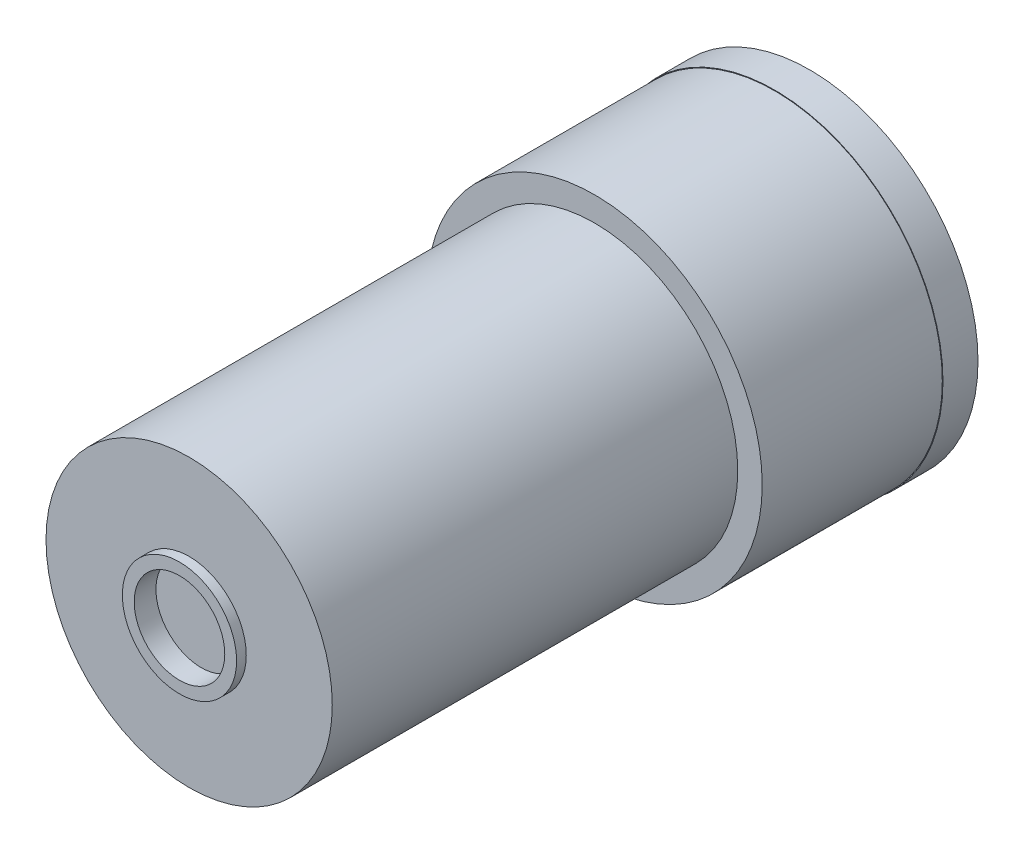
ISO-10303-21;
HEADER;
FILE_DESCRIPTION(('STEP AP214'),'2;1');
FILE_NAME('part.step','',(''),(''),'','','');
FILE_SCHEMA(('AUTOMOTIVE_DESIGN { 1 0 10303 214 1 1 1 1 }'));
ENDSEC;
DATA;
#1=APPLICATION_CONTEXT('core data for automotive mechanical design processes');
#2=APPLICATION_PROTOCOL_DEFINITION('international standard','automotive_design',2000,#1);
#3=PRODUCT_CONTEXT('',#1,'mechanical');
#4=PRODUCT('Part','Part','',(#3));
#5=PRODUCT_RELATED_PRODUCT_CATEGORY('part','',(#4));
#6=PRODUCT_DEFINITION_FORMATION('','',#4);
#7=PRODUCT_DEFINITION_CONTEXT('part definition',#1,'design');
#8=PRODUCT_DEFINITION('design','',#6,#7);
#9=PRODUCT_DEFINITION_SHAPE('','',#8);
#10=(LENGTH_UNIT() NAMED_UNIT(*) SI_UNIT(.MILLI.,.METRE.));
#11=(NAMED_UNIT(*) PLANE_ANGLE_UNIT() SI_UNIT($,.RADIAN.));
#12=(NAMED_UNIT(*) SI_UNIT($,.STERADIAN.) SOLID_ANGLE_UNIT());
#13=UNCERTAINTY_MEASURE_WITH_UNIT(LENGTH_MEASURE(1.E-05),#10,'distance_accuracy_value','');
#14=(GEOMETRIC_REPRESENTATION_CONTEXT(3) GLOBAL_UNCERTAINTY_ASSIGNED_CONTEXT((#13)) GLOBAL_UNIT_ASSIGNED_CONTEXT((#10,
#11,#12)) REPRESENTATION_CONTEXT('',''));
#15=CARTESIAN_POINT('',(0.,0.,0.));
#16=DIRECTION('',(0.,0.,1.));
#17=DIRECTION('',(1.,0.,0.));
#18=AXIS2_PLACEMENT_3D('',#15,#16,#17);
#19=CARTESIAN_POINT('',(13.2884291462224,-4.79991951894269,-66.141492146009));
#20=DIRECTION('',(0.,0.,-1.));
#21=DIRECTION('',(-1.,0.,0.));
#22=AXIS2_PLACEMENT_3D('',#19,#20,#21);
#23=PLANE('',#22);
#24=CARTESIAN_POINT('',(13.2884291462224,-4.79991951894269,-66.141492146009));
#25=DIRECTION('',(0.,0.,-1.));
#26=DIRECTION('',(-1.,0.,0.));
#27=AXIS2_PLACEMENT_3D('',#24,#25,#26);
#28=CIRCLE('',#27,2.7305);
#29=CARTESIAN_POINT('',(10.5579291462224,-4.79991951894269,-66.141492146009));
#30=VERTEX_POINT('',#29);
#31=EDGE_CURVE('E399',#30,#30,#28,.T.);
#32=ORIENTED_EDGE('',*,*,#31,.T.);
#33=EDGE_LOOP('',(#32));
#34=FACE_BOUND('',#33,.T.);
#35=DIRECTION('',(1.,0.,0.));
#36=VECTOR('',#35,1.);
#37=CARTESIAN_POINT('',(13.2884291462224,-5.30791951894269,-66.141492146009));
#38=LINE('',#37,#36);
#39=CARTESIAN_POINT('',(11.7009291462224,-5.30791951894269,-66.141492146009));
#40=VERTEX_POINT('',#39);
#41=CARTESIAN_POINT('',(12.7804291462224,-5.30791951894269,-66.141492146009));
#42=VERTEX_POINT('',#41);
#43=EDGE_CURVE('E98',#40,#42,#38,.T.);
#44=ORIENTED_EDGE('',*,*,#43,.T.);
#45=DIRECTION('',(0.,-1.,0.));
#46=VECTOR('',#45,1.);
#47=CARTESIAN_POINT('',(12.7804291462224,-4.79991951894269,-66.141492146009));
#48=LINE('',#47,#46);
#49=CARTESIAN_POINT('',(12.7804291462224,-6.38741951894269,-66.141492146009));
#50=VERTEX_POINT('',#49);
#51=EDGE_CURVE('E12',#42,#50,#48,.T.);
#52=ORIENTED_EDGE('',*,*,#51,.T.);
#53=DIRECTION('',(-1.,0.,0.));
#54=VECTOR('',#53,1.);
#55=CARTESIAN_POINT('',(13.2884291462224,-6.38741951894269,-66.141492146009));
#56=LINE('',#55,#54);
#57=CARTESIAN_POINT('',(13.7964291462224,-6.38741951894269,-66.141492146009));
#58=VERTEX_POINT('',#57);
#59=EDGE_CURVE('E757',#58,#50,#56,.T.);
#60=ORIENTED_EDGE('',*,*,#59,.F.);
#61=DIRECTION('',(0.,-1.,0.));
#62=VECTOR('',#61,1.);
#63=CARTESIAN_POINT('',(13.7964291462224,-4.79991951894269,-66.141492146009));
#64=LINE('',#63,#62);
#65=CARTESIAN_POINT('',(13.7964291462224,-5.30791951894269,-66.141492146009));
#66=VERTEX_POINT('',#65);
#67=EDGE_CURVE('E755',#66,#58,#64,.T.);
#68=ORIENTED_EDGE('',*,*,#67,.F.);
#69=DIRECTION('',(1.,0.,0.));
#70=VECTOR('',#69,1.);
#71=CARTESIAN_POINT('',(13.2884291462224,-5.30791951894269,-66.141492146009));
#72=LINE('',#71,#70);
#73=CARTESIAN_POINT('',(14.8759291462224,-5.30791951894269,-66.141492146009));
#74=VERTEX_POINT('',#73);
#75=EDGE_CURVE('E747',#66,#74,#72,.T.);
#76=ORIENTED_EDGE('',*,*,#75,.T.);
#77=DIRECTION('',(0.,-1.,0.));
#78=VECTOR('',#77,1.);
#79=CARTESIAN_POINT('',(14.8759291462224,-4.79991951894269,-66.141492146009));
#80=LINE('',#79,#78);
#81=CARTESIAN_POINT('',(14.8759291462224,-4.29191951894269,-66.141492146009));
#82=VERTEX_POINT('',#81);
#83=EDGE_CURVE('E745',#82,#74,#80,.T.);
#84=ORIENTED_EDGE('',*,*,#83,.F.);
#85=DIRECTION('',(1.,0.,0.));
#86=VECTOR('',#85,1.);
#87=CARTESIAN_POINT('',(13.2884291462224,-4.29191951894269,-66.141492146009));
#88=LINE('',#87,#86);
#89=CARTESIAN_POINT('',(13.7964291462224,-4.29191951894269,-66.141492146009));
#90=VERTEX_POINT('',#89);
#91=EDGE_CURVE('E743',#90,#82,#88,.T.);
#92=ORIENTED_EDGE('',*,*,#91,.F.);
#93=DIRECTION('',(0.,-1.,0.));
#94=VECTOR('',#93,1.);
#95=CARTESIAN_POINT('',(13.7964291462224,-4.79991951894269,-66.141492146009));
#96=LINE('',#95,#94);
#97=CARTESIAN_POINT('',(13.7964291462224,-3.21241951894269,-66.141492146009));
#98=VERTEX_POINT('',#97);
#99=EDGE_CURVE('E741',#98,#90,#96,.T.);
#100=ORIENTED_EDGE('',*,*,#99,.F.);
#101=DIRECTION('',(-1.,0.,0.));
#102=VECTOR('',#101,1.);
#103=CARTESIAN_POINT('',(13.2884291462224,-3.21241951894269,-66.141492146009));
#104=LINE('',#103,#102);
#105=CARTESIAN_POINT('',(12.7804291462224,-3.21241951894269,-66.141492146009));
#106=VERTEX_POINT('',#105);
#107=EDGE_CURVE('E285',#98,#106,#104,.T.);
#108=ORIENTED_EDGE('',*,*,#107,.T.);
#109=DIRECTION('',(0.,-1.,0.));
#110=VECTOR('',#109,1.);
#111=CARTESIAN_POINT('',(12.7804291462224,-4.79991951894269,-66.141492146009));
#112=LINE('',#111,#110);
#113=CARTESIAN_POINT('',(12.7804291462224,-4.29191951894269,-66.141492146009));
#114=VERTEX_POINT('',#113);
#115=EDGE_CURVE('E737',#106,#114,#112,.T.);
#116=ORIENTED_EDGE('',*,*,#115,.T.);
#117=DIRECTION('',(1.,0.,0.));
#118=VECTOR('',#117,1.);
#119=CARTESIAN_POINT('',(13.2884291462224,-4.29191951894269,-66.141492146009));
#120=LINE('',#119,#118);
#121=CARTESIAN_POINT('',(11.7009291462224,-4.29191951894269,-66.141492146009));
#122=VERTEX_POINT('',#121);
#123=EDGE_CURVE('E750',#122,#114,#120,.T.);
#124=ORIENTED_EDGE('',*,*,#123,.F.);
#125=DIRECTION('',(0.,-1.,0.));
#126=VECTOR('',#125,1.);
#127=CARTESIAN_POINT('',(11.7009291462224,-4.79991951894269,-66.141492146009));
#128=LINE('',#127,#126);
#129=EDGE_CURVE('E752',#122,#40,#128,.T.);
#130=ORIENTED_EDGE('',*,*,#129,.T.);
#131=EDGE_LOOP('',(#44,#52,#60,#68,#76,#84,#92,#100,#108,#116,#124,#130));
#132=FACE_BOUND('',#131,.T.);
#133=ADVANCED_FACE('F88',(#34,#132),#23,.T.);
#134=CARTESIAN_POINT('',(1.23536291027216E-13,-17.6911,-66.268492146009));
#135=DIRECTION('',(0.,0.,-1.));
#136=DIRECTION('',(-1.,0.,0.));
#137=AXIS2_PLACEMENT_3D('',#134,#135,#136);
#138=PLANE('',#137);
#139=CARTESIAN_POINT('',(0.,-8.92105905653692,-66.268492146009));
#140=DIRECTION('',(0.,0.,-1.));
#141=DIRECTION('',(-1.,0.,0.));
#142=AXIS2_PLACEMENT_3D('',#139,#140,#141);
#143=CIRCLE('',#142,2.54);
#144=CARTESIAN_POINT('',(-2.54,-8.92105905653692,-66.268492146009));
#145=VERTEX_POINT('',#144);
#146=EDGE_CURVE('E497',#145,#145,#143,.F.);
#147=ORIENTED_EDGE('',*,*,#146,.F.);
#148=EDGE_LOOP('',(#147));
#149=FACE_BOUND('',#148,.T.);
#150=CARTESIAN_POINT('',(0.,-8.92105905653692,-66.268492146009));
#151=DIRECTION('',(0.,0.,-1.));
#152=DIRECTION('',(-1.,0.,0.));
#153=AXIS2_PLACEMENT_3D('',#150,#151,#152);
#154=CIRCLE('',#153,2.4765);
#155=CARTESIAN_POINT('',(-2.4765,-8.92105905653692,-66.268492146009));
#156=VERTEX_POINT('',#155);
#157=EDGE_CURVE('E423',#156,#156,#154,.T.);
#158=ORIENTED_EDGE('',*,*,#157,.F.);
#159=EDGE_LOOP('',(#158));
#160=FACE_BOUND('',#159,.T.);
#161=ADVANCED_FACE('F628',(#149,#160),#138,.T.);
#162=CARTESIAN_POINT('',(13.2884291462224,-4.79991951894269,-66.268492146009));
#163=DIRECTION('',(0.,0.,-1.));
#164=DIRECTION('',(-1.,0.,0.));
#165=AXIS2_PLACEMENT_3D('',#162,#163,#164);
#166=CIRCLE('',#165,2.7305);
#167=CARTESIAN_POINT('',(10.5579291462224,-4.79991951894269,-66.268492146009));
#168=VERTEX_POINT('',#167);
#169=EDGE_CURVE('E400',#168,#168,#166,.T.);
#170=ORIENTED_EDGE('',*,*,#169,.F.);
#171=EDGE_LOOP('',(#170));
#172=FACE_BOUND('',#171,.T.);
#173=CARTESIAN_POINT('',(-12.3699011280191,6.82694094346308,-66.268492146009));
#174=DIRECTION('',(0.,0.,-1.));
#175=DIRECTION('',(-1.,0.,0.));
#176=AXIS2_PLACEMENT_3D('',#173,#174,#175);
#177=CIRCLE('',#176,2.7305);
#178=CARTESIAN_POINT('',(-15.1004011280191,6.82694094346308,-66.268492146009));
#179=VERTEX_POINT('',#178);
#180=EDGE_CURVE('E403',#179,#179,#177,.T.);
#181=ORIENTED_EDGE('',*,*,#180,.F.);
#182=EDGE_LOOP('',(#181));
#183=FACE_BOUND('',#182,.T.);
#184=CARTESIAN_POINT('',(0.,0.,-66.268492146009));
#185=DIRECTION('',(0.,0.,1.));
#186=DIRECTION('',(1.,0.,0.));
#187=AXIS2_PLACEMENT_3D('',#184,#185,#186);
#188=CIRCLE('',#187,17.6911);
#189=CARTESIAN_POINT('',(17.6911,0.,-66.268492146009));
#190=VERTEX_POINT('',#189);
#191=EDGE_CURVE('E494',#190,#190,#188,.T.);
#192=ORIENTED_EDGE('',*,*,#191,.F.);
#193=EDGE_LOOP('',(#192));
#194=FACE_BOUND('',#193,.T.);
#195=CARTESIAN_POINT('',(-10.2108,-8.92105905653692,-66.268492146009));
#196=DIRECTION('',(0.,0.,-1.));
#197=DIRECTION('',(-1.,0.,0.));
#198=AXIS2_PLACEMENT_3D('',#195,#196,#197);
#199=CIRCLE('',#198,1.25);
#200=CARTESIAN_POINT('',(-11.4608,-8.92105905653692,-66.268492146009));
#201=VERTEX_POINT('',#200);
#202=EDGE_CURVE('E449',#201,#201,#199,.T.);
#203=ORIENTED_EDGE('',*,*,#202,.F.);
#204=EDGE_LOOP('',(#203));
#205=FACE_BOUND('',#204,.T.);
#206=CARTESIAN_POINT('',(0.,13.13815,-66.268492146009));
#207=DIRECTION('',(0.,0.,-1.));
#208=DIRECTION('',(-1.,0.,0.));
#209=AXIS2_PLACEMENT_3D('',#206,#207,#208);
#210=CIRCLE('',#209,1.25);
#211=CARTESIAN_POINT('',(-1.25,13.13815,-66.268492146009));
#212=VERTEX_POINT('',#211);
#213=EDGE_CURVE('E443',#212,#212,#210,.T.);
#214=ORIENTED_EDGE('',*,*,#213,.F.);
#215=EDGE_LOOP('',(#214));
#216=FACE_BOUND('',#215,.T.);
#217=CARTESIAN_POINT('',(10.2108,-8.92105905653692,-66.268492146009));
#218=DIRECTION('',(0.,0.,-1.));
#219=DIRECTION('',(-1.,0.,0.));
#220=AXIS2_PLACEMENT_3D('',#217,#218,#219);
#221=CIRCLE('',#220,1.25);
#222=CARTESIAN_POINT('',(8.9608,-8.92105905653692,-66.268492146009));
#223=VERTEX_POINT('',#222);
#224=EDGE_CURVE('E435',#223,#223,#221,.T.);
#225=ORIENTED_EDGE('',*,*,#224,.F.);
#226=EDGE_LOOP('',(#225));
#227=FACE_BOUND('',#226,.T.);
#228=CARTESIAN_POINT('',(0.,-8.92105905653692,-66.268492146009));
#229=DIRECTION('',(0.,0.,-1.));
#230=DIRECTION('',(-1.,0.,0.));
#231=AXIS2_PLACEMENT_3D('',#228,#229,#230);
#232=CIRCLE('',#231,5.9944);
#233=CARTESIAN_POINT('',(-5.9944,-8.92105905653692,-66.268492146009));
#234=VERTEX_POINT('',#233);
#235=EDGE_CURVE('E428',#234,#234,#232,.T.);
#236=ORIENTED_EDGE('',*,*,#235,.F.);
#237=EDGE_LOOP('',(#236));
#238=FACE_BOUND('',#237,.T.);
#239=ADVANCED_FACE('F626',(#172,#183,#194,#205,#216,#227,#238),#138,.T.);
#240=CARTESIAN_POINT('',(0.,0.,0.));
#241=DIRECTION('',(0.,0.,1.));
#242=DIRECTION('',(1.,0.,0.));
#243=AXIS2_PLACEMENT_3D('',#240,#241,#242);
#244=CYLINDRICAL_SURFACE('',#243,17.6911);
#245=ORIENTED_EDGE('',*,*,#191,.T.);
#246=EDGE_LOOP('',(#245));
#247=FACE_BOUND('',#246,.T.);
#248=CARTESIAN_POINT('',(0.,0.,-62.585492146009));
#249=DIRECTION('',(0.,0.,1.));
#250=DIRECTION('',(1.,0.,0.));
#251=AXIS2_PLACEMENT_3D('',#248,#249,#250);
#252=CIRCLE('',#251,17.6911);
#253=CARTESIAN_POINT('',(17.6911,0.,-62.585492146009));
#254=VERTEX_POINT('',#253);
#255=EDGE_CURVE('E491',#254,#254,#252,.T.);
#256=ORIENTED_EDGE('',*,*,#255,.F.);
#257=EDGE_LOOP('',(#256));
#258=FACE_BOUND('',#257,.T.);
#259=ADVANCED_FACE('F623',(#247,#258),#244,.T.);
#260=CARTESIAN_POINT('',(1.23536291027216E-13,-17.6911,-62.585492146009));
#261=DIRECTION('',(0.,0.,1.));
#262=DIRECTION('',(1.,0.,0.));
#263=AXIS2_PLACEMENT_3D('',#260,#261,#262);
#264=PLANE('',#263);
#265=ORIENTED_EDGE('',*,*,#255,.T.);
#266=EDGE_LOOP('',(#265));
#267=FACE_BOUND('',#266,.T.);
#268=CARTESIAN_POINT('',(0.,0.,-62.585492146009));
#269=DIRECTION('',(0.,0.,1.));
#270=DIRECTION('',(1.,0.,0.));
#271=AXIS2_PLACEMENT_3D('',#268,#269,#270);
#272=CIRCLE('',#271,17.62125);
#273=CARTESIAN_POINT('',(17.62125,0.,-62.585492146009));
#274=VERTEX_POINT('',#273);
#275=EDGE_CURVE('E488',#274,#274,#272,.T.);
#276=ORIENTED_EDGE('',*,*,#275,.F.);
#277=EDGE_LOOP('',(#276));
#278=FACE_BOUND('',#277,.T.);
#279=ADVANCED_FACE('F619',(#267,#278),#264,.T.);
#280=CARTESIAN_POINT('',(0.,0.,0.));
#281=DIRECTION('',(0.,0.,1.));
#282=DIRECTION('',(1.,0.,0.));
#283=AXIS2_PLACEMENT_3D('',#280,#281,#282);
#284=CYLINDRICAL_SURFACE('',#283,17.62125);
#285=ORIENTED_EDGE('',*,*,#275,.T.);
#286=EDGE_LOOP('',(#285));
#287=FACE_BOUND('',#286,.T.);
#288=CARTESIAN_POINT('',(0.,0.,-43.6499));
#289=DIRECTION('',(0.,0.,1.));
#290=DIRECTION('',(1.,0.,0.));
#291=AXIS2_PLACEMENT_3D('',#288,#289,#290);
#292=CIRCLE('',#291,17.62125);
#293=CARTESIAN_POINT('',(17.62125,0.,-43.6499));
#294=VERTEX_POINT('',#293);
#295=EDGE_CURVE('E485',#294,#294,#292,.T.);
#296=ORIENTED_EDGE('',*,*,#295,.F.);
#297=EDGE_LOOP('',(#296));
#298=FACE_BOUND('',#297,.T.);
#299=ADVANCED_FACE('F615',(#287,#298),#284,.T.);
#300=CARTESIAN_POINT('',(1.05090096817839E-13,-15.0495,-43.6499));
#301=DIRECTION('',(0.,0.,1.));
#302=DIRECTION('',(1.,0.,0.));
#303=AXIS2_PLACEMENT_3D('',#300,#301,#302);
#304=PLANE('',#303);
#305=ORIENTED_EDGE('',*,*,#295,.T.);
#306=EDGE_LOOP('',(#305));
#307=FACE_BOUND('',#306,.T.);
#308=CARTESIAN_POINT('',(0.,0.,-43.6499));
#309=DIRECTION('',(0.,0.,1.));
#310=DIRECTION('',(1.,0.,0.));
#311=AXIS2_PLACEMENT_3D('',#308,#309,#310);
#312=CIRCLE('',#311,15.0495);
#313=CARTESIAN_POINT('',(15.0495,0.,-43.6499));
#314=VERTEX_POINT('',#313);
#315=EDGE_CURVE('E482',#314,#314,#312,.T.);
#316=ORIENTED_EDGE('',*,*,#315,.F.);
#317=EDGE_LOOP('',(#316));
#318=FACE_BOUND('',#317,.T.);
#319=ADVANCED_FACE('F611',(#307,#318),#304,.T.);
#320=CARTESIAN_POINT('',(0.,0.,0.));
#321=DIRECTION('',(0.,0.,1.));
#322=DIRECTION('',(1.,0.,0.));
#323=AXIS2_PLACEMENT_3D('',#320,#321,#322);
#324=CYLINDRICAL_SURFACE('',#323,15.0495);
#325=ORIENTED_EDGE('',*,*,#315,.T.);
#326=EDGE_LOOP('',(#325));
#327=FACE_BOUND('',#326,.T.);
#328=CARTESIAN_POINT('',(0.,0.,-1.016));
#329=DIRECTION('',(0.,0.,1.));
#330=DIRECTION('',(1.,0.,0.));
#331=AXIS2_PLACEMENT_3D('',#328,#329,#330);
#332=CIRCLE('',#331,15.0495);
#333=CARTESIAN_POINT('',(15.0495,0.,-1.016));
#334=VERTEX_POINT('',#333);
#335=EDGE_CURVE('E479',#334,#334,#332,.T.);
#336=ORIENTED_EDGE('',*,*,#335,.F.);
#337=EDGE_LOOP('',(#336));
#338=FACE_BOUND('',#337,.T.);
#339=ADVANCED_FACE('F607',(#327,#338),#324,.T.);
#340=CARTESIAN_POINT('',(0.,-6.0071,-1.016));
#341=DIRECTION('',(0.,0.,1.));
#342=DIRECTION('',(1.,0.,0.));
#343=AXIS2_PLACEMENT_3D('',#340,#341,#342);
#344=PLANE('',#343);
#345=ORIENTED_EDGE('',*,*,#335,.T.);
#346=EDGE_LOOP('',(#345));
#347=FACE_BOUND('',#346,.T.);
#348=CARTESIAN_POINT('',(0.,0.,-1.016));
#349=DIRECTION('',(0.,0.,1.));
#350=DIRECTION('',(1.,0.,0.));
#351=AXIS2_PLACEMENT_3D('',#348,#349,#350);
#352=CIRCLE('',#351,6.0071);
#353=CARTESIAN_POINT('',(6.0071,0.,-1.016));
#354=VERTEX_POINT('',#353);
#355=EDGE_CURVE('E476',#354,#354,#352,.T.);
#356=ORIENTED_EDGE('',*,*,#355,.F.);
#357=EDGE_LOOP('',(#356));
#358=FACE_BOUND('',#357,.T.);
#359=ADVANCED_FACE('F603',(#347,#358),#344,.T.);
#360=CARTESIAN_POINT('',(0.,0.,0.));
#361=DIRECTION('',(0.,0.,1.));
#362=DIRECTION('',(1.,0.,0.));
#363=AXIS2_PLACEMENT_3D('',#360,#361,#362);
#364=CYLINDRICAL_SURFACE('',#363,6.0071);
#365=ORIENTED_EDGE('',*,*,#355,.T.);
#366=EDGE_LOOP('',(#365));
#367=FACE_BOUND('',#366,.T.);
#368=CARTESIAN_POINT('',(0.,0.,0.));
#369=DIRECTION('',(0.,0.,1.));
#370=DIRECTION('',(1.,0.,0.));
#371=AXIS2_PLACEMENT_3D('',#368,#369,#370);
#372=CIRCLE('',#371,6.0071);
#373=CARTESIAN_POINT('',(6.0071,0.,0.));
#374=VERTEX_POINT('',#373);
#375=EDGE_CURVE('E473',#374,#374,#372,.T.);
#376=ORIENTED_EDGE('',*,*,#375,.F.);
#377=EDGE_LOOP('',(#376));
#378=FACE_BOUND('',#377,.T.);
#379=ADVANCED_FACE('F599',(#367,#378),#364,.T.);
#380=CARTESIAN_POINT('',(0.,0.,0.));
#381=DIRECTION('',(0.,0.,1.));
#382=DIRECTION('',(1.,0.,0.));
#383=AXIS2_PLACEMENT_3D('',#380,#381,#382);
#384=PLANE('',#383);
#385=CARTESIAN_POINT('',(0.,0.,0.));
#386=DIRECTION('',(0.,0.,1.));
#387=DIRECTION('',(1.,0.,0.));
#388=AXIS2_PLACEMENT_3D('',#385,#386,#387);
#389=CIRCLE('',#388,4.7625);
#390=CARTESIAN_POINT('',(4.7625,0.,0.));
#391=VERTEX_POINT('',#390);
#392=EDGE_CURVE('E799',#391,#391,#389,.T.);
#393=ORIENTED_EDGE('',*,*,#392,.F.);
#394=EDGE_LOOP('',(#393));
#395=FACE_BOUND('',#394,.T.);
#396=ORIENTED_EDGE('',*,*,#375,.T.);
#397=EDGE_LOOP('',(#396));
#398=FACE_BOUND('',#397,.T.);
#399=ADVANCED_FACE('F566',(#395,#398),#384,.T.);
#400=CARTESIAN_POINT('',(-10.2108,-8.92105905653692,-57.886492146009));
#401=DIRECTION('',(0.,0.,-1.));
#402=DIRECTION('',(-1.,0.,0.));
#403=AXIS2_PLACEMENT_3D('',#400,#401,#402);
#404=CONICAL_SURFACE('',#403,1.25,1.02974425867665);
#405=CARTESIAN_POINT('',(-10.2108,-8.92105905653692,-57.1354163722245));
#406=VERTEX_POINT('',#405);
#407=VERTEX_LOOP('',#406);
#408=FACE_BOUND('',#407,.T.);
#409=CARTESIAN_POINT('',(-10.2108,-8.92105905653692,-57.886492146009));
#410=DIRECTION('',(0.,0.,-1.));
#411=DIRECTION('',(-1.,0.,0.));
#412=AXIS2_PLACEMENT_3D('',#409,#410,#411);
#413=CIRCLE('',#412,1.25);
#414=CARTESIAN_POINT('',(-11.4608,-8.92105905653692,-57.886492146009));
#415=VERTEX_POINT('',#414);
#416=EDGE_CURVE('E452',#415,#415,#413,.T.);
#417=ORIENTED_EDGE('',*,*,#416,.T.);
#418=EDGE_LOOP('',(#417));
#419=FACE_BOUND('',#418,.T.);
#420=ADVANCED_FACE('F562',(#408,#419),#404,.F.);
#421=CARTESIAN_POINT('',(-10.2108,-8.92105905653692,-66.268492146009));
#422=DIRECTION('',(0.,0.,-1.));
#423=DIRECTION('',(-1.,0.,0.));
#424=AXIS2_PLACEMENT_3D('',#421,#422,#423);
#425=CYLINDRICAL_SURFACE('',#424,1.25);
#426=ORIENTED_EDGE('',*,*,#416,.F.);
#427=EDGE_LOOP('',(#426));
#428=FACE_BOUND('',#427,.T.);
#429=ORIENTED_EDGE('',*,*,#202,.T.);
#430=EDGE_LOOP('',(#429));
#431=FACE_BOUND('',#430,.T.);
#432=ADVANCED_FACE('F558',(#428,#431),#425,.F.);
#433=CARTESIAN_POINT('',(0.,13.13815,-57.886492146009));
#434=DIRECTION('',(0.,0.,-1.));
#435=DIRECTION('',(-1.,0.,0.));
#436=AXIS2_PLACEMENT_3D('',#433,#434,#435);
#437=CONICAL_SURFACE('',#436,1.25,1.02974425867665);
#438=CARTESIAN_POINT('',(0.,13.13815,-57.1354163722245));
#439=VERTEX_POINT('',#438);
#440=VERTEX_LOOP('',#439);
#441=FACE_BOUND('',#440,.T.);
#442=CARTESIAN_POINT('',(0.,13.13815,-57.886492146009));
#443=DIRECTION('',(0.,0.,-1.));
#444=DIRECTION('',(-1.,0.,0.));
#445=AXIS2_PLACEMENT_3D('',#442,#443,#444);
#446=CIRCLE('',#445,1.25);
#447=CARTESIAN_POINT('',(-1.25,13.13815,-57.886492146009));
#448=VERTEX_POINT('',#447);
#449=EDGE_CURVE('E446',#448,#448,#446,.T.);
#450=ORIENTED_EDGE('',*,*,#449,.T.);
#451=EDGE_LOOP('',(#450));
#452=FACE_BOUND('',#451,.T.);
#453=ADVANCED_FACE('F554',(#441,#452),#437,.F.);
#454=CARTESIAN_POINT('',(0.,13.13815,-66.268492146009));
#455=DIRECTION('',(0.,0.,-1.));
#456=DIRECTION('',(-1.,0.,0.));
#457=AXIS2_PLACEMENT_3D('',#454,#455,#456);
#458=CYLINDRICAL_SURFACE('',#457,1.25);
#459=ORIENTED_EDGE('',*,*,#449,.F.);
#460=EDGE_LOOP('',(#459));
#461=FACE_BOUND('',#460,.T.);
#462=ORIENTED_EDGE('',*,*,#213,.T.);
#463=EDGE_LOOP('',(#462));
#464=FACE_BOUND('',#463,.T.);
#465=ADVANCED_FACE('F550',(#461,#464),#458,.F.);
#466=CARTESIAN_POINT('',(10.2108,-8.92105905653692,-57.886492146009));
#467=DIRECTION('',(0.,0.,-1.));
#468=DIRECTION('',(-1.,0.,0.));
#469=AXIS2_PLACEMENT_3D('',#466,#467,#468);
#470=CONICAL_SURFACE('',#469,1.25,1.02974425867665);
#471=CARTESIAN_POINT('',(10.2108,-8.92105905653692,-57.1354163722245));
#472=VERTEX_POINT('',#471);
#473=VERTEX_LOOP('',#472);
#474=FACE_BOUND('',#473,.T.);
#475=CARTESIAN_POINT('',(10.2108,-8.92105905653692,-57.886492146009));
#476=DIRECTION('',(0.,0.,-1.));
#477=DIRECTION('',(-1.,0.,0.));
#478=AXIS2_PLACEMENT_3D('',#475,#476,#477);
#479=CIRCLE('',#478,1.25);
#480=CARTESIAN_POINT('',(8.9608,-8.92105905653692,-57.886492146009));
#481=VERTEX_POINT('',#480);
#482=EDGE_CURVE('E440',#481,#481,#479,.T.);
#483=ORIENTED_EDGE('',*,*,#482,.T.);
#484=EDGE_LOOP('',(#483));
#485=FACE_BOUND('',#484,.T.);
#486=ADVANCED_FACE('F546',(#474,#485),#470,.F.);
#487=CARTESIAN_POINT('',(10.2108,-8.92105905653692,-66.268492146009));
#488=DIRECTION('',(0.,0.,-1.));
#489=DIRECTION('',(-1.,0.,0.));
#490=AXIS2_PLACEMENT_3D('',#487,#488,#489);
#491=CYLINDRICAL_SURFACE('',#490,1.25);
#492=ORIENTED_EDGE('',*,*,#482,.F.);
#493=EDGE_LOOP('',(#492));
#494=FACE_BOUND('',#493,.T.);
#495=ORIENTED_EDGE('',*,*,#224,.T.);
#496=EDGE_LOOP('',(#495));
#497=FACE_BOUND('',#496,.T.);
#498=ADVANCED_FACE('F542',(#494,#497),#491,.F.);
#499=CARTESIAN_POINT('',(0.,-8.92105905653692,-68.046492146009));
#500=DIRECTION('',(0.,0.,1.));
#501=DIRECTION('',(1.,0.,0.));
#502=AXIS2_PLACEMENT_3D('',#499,#500,#501);
#503=CYLINDRICAL_SURFACE('',#502,2.54);
#504=CARTESIAN_POINT('',(0.,-8.92105905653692,-68.046492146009));
#505=DIRECTION('',(0.,0.,-1.));
#506=DIRECTION('',(-1.,0.,0.));
#507=AXIS2_PLACEMENT_3D('',#504,#505,#506);
#508=CIRCLE('',#507,2.54);
#509=CARTESIAN_POINT('',(-2.54,-8.92105905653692,-68.046492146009));
#510=VERTEX_POINT('',#509);
#511=EDGE_CURVE('E429',#510,#510,#508,.T.);
#512=ORIENTED_EDGE('',*,*,#511,.T.);
#513=EDGE_LOOP('',(#512));
#514=FACE_BOUND('',#513,.T.);
#515=ORIENTED_EDGE('',*,*,#146,.T.);
#516=EDGE_LOOP('',(#515));
#517=FACE_BOUND('',#516,.T.);
#518=ADVANCED_FACE('F538',(#514,#517),#503,.F.);
#519=CARTESIAN_POINT('',(0.,-8.92105905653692,-68.046492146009));
#520=DIRECTION('',(0.,0.,1.));
#521=DIRECTION('',(1.,0.,0.));
#522=AXIS2_PLACEMENT_3D('',#519,#520,#521);
#523=CYLINDRICAL_SURFACE('',#522,5.9944);
#524=CARTESIAN_POINT('',(0.,-8.92105905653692,-68.046492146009));
#525=DIRECTION('',(0.,0.,-1.));
#526=DIRECTION('',(-1.,0.,0.));
#527=AXIS2_PLACEMENT_3D('',#524,#525,#526);
#528=CIRCLE('',#527,5.9944);
#529=CARTESIAN_POINT('',(-5.9944,-8.92105905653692,-68.046492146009));
#530=VERTEX_POINT('',#529);
#531=EDGE_CURVE('E432',#530,#530,#528,.T.);
#532=ORIENTED_EDGE('',*,*,#531,.F.);
#533=EDGE_LOOP('',(#532));
#534=FACE_BOUND('',#533,.T.);
#535=ORIENTED_EDGE('',*,*,#235,.T.);
#536=EDGE_LOOP('',(#535));
#537=FACE_BOUND('',#536,.T.);
#538=ADVANCED_FACE('F534',(#534,#537),#523,.T.);
#539=CARTESIAN_POINT('',(0.,0.,-68.046492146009));
#540=DIRECTION('',(0.,0.,-1.));
#541=DIRECTION('',(-1.,0.,0.));
#542=AXIS2_PLACEMENT_3D('',#539,#540,#541);
#543=PLANE('',#542);
#544=ORIENTED_EDGE('',*,*,#511,.F.);
#545=EDGE_LOOP('',(#544));
#546=FACE_BOUND('',#545,.T.);
#547=ORIENTED_EDGE('',*,*,#531,.T.);
#548=EDGE_LOOP('',(#547));
#549=FACE_BOUND('',#548,.T.);
#550=ADVANCED_FACE('F530',(#546,#549),#543,.T.);
#551=CARTESIAN_POINT('',(0.,-8.92105905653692,-78.841492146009));
#552=DIRECTION('',(0.,0.,1.));
#553=DIRECTION('',(1.,0.,0.));
#554=AXIS2_PLACEMENT_3D('',#551,#552,#553);
#555=CYLINDRICAL_SURFACE('',#554,2.4765);
#556=DIRECTION('',(0.,0.,-1.));
#557=VECTOR('',#556,1.);
#558=CARTESIAN_POINT('',(-2.0183013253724,-7.48595905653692,-67.157492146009));
#559=LINE('',#558,#557);
#560=CARTESIAN_POINT('',(-2.0183013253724,-7.48595905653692,-67.157492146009));
#561=VERTEX_POINT('',#560);
#562=CARTESIAN_POINT('',(-2.0183013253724,-7.48595905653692,-78.079492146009));
#563=VERTEX_POINT('',#562);
#564=EDGE_CURVE('E420',#561,#563,#559,.T.);
#565=ORIENTED_EDGE('',*,*,#564,.T.);
#566=CARTESIAN_POINT('',(0.,-8.92105905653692,-78.079492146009));
#567=DIRECTION('',(0.,0.,-1.));
#568=DIRECTION('',(-1.,0.,0.));
#569=AXIS2_PLACEMENT_3D('',#566,#567,#568);
#570=CIRCLE('',#569,2.4765);
#571=CARTESIAN_POINT('',(2.0183013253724,-7.48595905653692,-78.079492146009));
#572=VERTEX_POINT('',#571);
#573=EDGE_CURVE('E701',#563,#572,#570,.F.);
#574=ORIENTED_EDGE('',*,*,#573,.T.);
#575=DIRECTION('',(0.,0.,-1.));
#576=VECTOR('',#575,1.);
#577=CARTESIAN_POINT('',(2.0183013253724,-7.48595905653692,-67.157492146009));
#578=LINE('',#577,#576);
#579=CARTESIAN_POINT('',(2.0183013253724,-7.48595905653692,-67.157492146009));
#580=VERTEX_POINT('',#579);
#581=EDGE_CURVE('E417',#580,#572,#578,.T.);
#582=ORIENTED_EDGE('',*,*,#581,.F.);
#583=CARTESIAN_POINT('',(0.,-8.92105905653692,-67.157492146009));
#584=DIRECTION('',(0.,0.,-1.));
#585=DIRECTION('',(-1.,0.,0.));
#586=AXIS2_PLACEMENT_3D('',#583,#584,#585);
#587=CIRCLE('',#586,2.4765);
#588=EDGE_CURVE('E412',#561,#580,#587,.T.);
#589=ORIENTED_EDGE('',*,*,#588,.F.);
#590=EDGE_LOOP('',(#565,#574,#582,#589));
#591=FACE_BOUND('',#590,.T.);
#592=ORIENTED_EDGE('',*,*,#157,.T.);
#593=EDGE_LOOP('',(#592));
#594=FACE_BOUND('',#593,.T.);
#595=ADVANCED_FACE('F526',(#591,#594),#555,.T.);
#596=CARTESIAN_POINT('',(0.,0.,-78.841492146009));
#597=DIRECTION('',(0.,0.,-1.));
#598=DIRECTION('',(-1.,0.,0.));
#599=AXIS2_PLACEMENT_3D('',#596,#597,#598);
#600=PLANE('',#599);
#601=DIRECTION('',(-1.,0.,0.));
#602=VECTOR('',#601,1.);
#603=CARTESIAN_POINT('',(2.0183013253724,-7.48595905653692,-78.841492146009));
#604=LINE('',#603,#602);
#605=CARTESIAN_POINT('',(0.938082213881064,-7.48595905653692,-78.841492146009));
#606=VERTEX_POINT('',#605);
#607=CARTESIAN_POINT('',(-0.938082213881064,-7.48595905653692,-78.841492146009));
#608=VERTEX_POINT('',#607);
#609=EDGE_CURVE('E409',#606,#608,#604,.T.);
#610=ORIENTED_EDGE('',*,*,#609,.F.);
#611=CARTESIAN_POINT('',(0.,-8.92105905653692,-78.841492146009));
#612=DIRECTION('',(0.,0.,-1.));
#613=DIRECTION('',(-1.,0.,0.));
#614=AXIS2_PLACEMENT_3D('',#611,#612,#613);
#615=CIRCLE('',#614,1.7145);
#616=EDGE_CURVE('E500',#606,#608,#615,.T.);
#617=ORIENTED_EDGE('',*,*,#616,.T.);
#618=EDGE_LOOP('',(#610,#617));
#619=FACE_BOUND('',#618,.T.);
#620=ADVANCED_FACE('F520',(#619),#600,.T.);
#621=CARTESIAN_POINT('',(2.0183013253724,-7.48595905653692,-67.157492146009));
#622=DIRECTION('',(0.,-1.,0.));
#623=DIRECTION('',(0.,0.,-1.));
#624=AXIS2_PLACEMENT_3D('',#621,#622,#623);
#625=PLANE('',#624);
#626=ORIENTED_EDGE('',*,*,#609,.T.);
#627=CARTESIAN_POINT('',(-0.938082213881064,-7.48595905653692,-78.841492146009));
#628=CARTESIAN_POINT('',(-0.98758482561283,-7.48595905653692,-78.8414969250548));
#629=CARTESIAN_POINT('',(-1.0371668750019,-7.48595905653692,-78.840046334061));
#630=CARTESIAN_POINT('',(-1.13641168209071,-7.48595905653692,-78.8332749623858));
#631=CARTESIAN_POINT('',(-1.18607245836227,-7.48595905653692,-78.8279264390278));
#632=CARTESIAN_POINT('',(-1.28543354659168,-7.48595905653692,-78.8122523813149));
#633=CARTESIAN_POINT('',(-1.33512263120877,-7.48595905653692,-78.801851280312));
#634=CARTESIAN_POINT('',(-1.4327648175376,-7.48595905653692,-78.7751530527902));
#635=CARTESIAN_POINT('',(-1.4807230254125,-7.48595905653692,-78.7588751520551));
#636=CARTESIAN_POINT('',(-1.57042091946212,-7.48595905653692,-78.7211014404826));
#637=CARTESIAN_POINT('',(-1.61235803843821,-7.48595905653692,-78.7000819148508));
#638=CARTESIAN_POINT('',(-1.69243566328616,-7.48595905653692,-78.6520200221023));
#639=CARTESIAN_POINT('',(-1.73059192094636,-7.48595905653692,-78.6250043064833));
#640=CARTESIAN_POINT('',(-1.80216394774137,-7.48595905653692,-78.564519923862));
#641=CARTESIAN_POINT('',(-1.83552541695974,-7.48595905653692,-78.5309861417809));
#642=CARTESIAN_POINT('',(-1.89526425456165,-7.48595905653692,-78.4580722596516));
#643=CARTESIAN_POINT('',(-1.9216378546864,-7.48595905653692,-78.4186890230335));
#644=CARTESIAN_POINT('',(-1.9630930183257,-7.48595905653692,-78.3400616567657));
#645=CARTESIAN_POINT('',(-1.97912073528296,-7.48595905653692,-78.301316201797));
#646=CARTESIAN_POINT('',(-2.00329030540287,-7.48595905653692,-78.2214916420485));
#647=CARTESIAN_POINT('',(-2.01145561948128,-7.48595905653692,-78.1804198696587));
#648=CARTESIAN_POINT('',(-2.01639598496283,-7.48595905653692,-78.1291285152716));
#649=CARTESIAN_POINT('',(-2.01711059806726,-7.48595905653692,-78.1192074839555));
#650=CARTESIAN_POINT('',(-2.01806241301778,-7.48595905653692,-78.0993565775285));
#651=CARTESIAN_POINT('',(-2.01830028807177,-7.48595905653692,-78.0894267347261));
#652=CARTESIAN_POINT('',(-2.01830132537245,-7.48595905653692,-78.079492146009));
#653=B_SPLINE_CURVE_WITH_KNOTS('',3,(#627,#628,#629,#630,#631,#632,#633,#634,#635,#636,#637,
#638,#639,#640,#641,#642,#643,#644,#645,#646,#647,#648,#649,#650,#651,#652),.UNSPECIFIED.,.F.,
.F.,(4,2,2,2,2,2,2,2,2,2,2,2,4),(0.,0.148607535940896,0.298283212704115,0.450269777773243,
0.601763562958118,0.742026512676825,0.881678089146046,1.02280401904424,1.16400589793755,
1.28906756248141,1.41375488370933,1.4435884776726,1.47337991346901),.UNSPECIFIED.);
#654=EDGE_CURVE('E509',#608,#563,#653,.T.);
#655=ORIENTED_EDGE('',*,*,#654,.T.);
#656=ORIENTED_EDGE('',*,*,#564,.F.);
#657=DIRECTION('',(-1.,0.,0.));
#658=VECTOR('',#657,1.);
#659=CARTESIAN_POINT('',(2.0183013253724,-7.48595905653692,-67.157492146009));
#660=LINE('',#659,#658);
#661=EDGE_CURVE('E414',#580,#561,#660,.T.);
#662=ORIENTED_EDGE('',*,*,#661,.F.);
#663=ORIENTED_EDGE('',*,*,#581,.T.);
#664=CARTESIAN_POINT('',(2.0183013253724,-7.48595905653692,-78.079492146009));
#665=CARTESIAN_POINT('',(2.01835698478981,-7.48595905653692,-78.1161637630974));
#666=CARTESIAN_POINT('',(2.01505737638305,-7.48595905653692,-78.1527944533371));
#667=CARTESIAN_POINT('',(2.0021962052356,-7.48595905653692,-78.2247703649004));
#668=CARTESIAN_POINT('',(1.99266380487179,-7.48595905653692,-78.2601207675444));
#669=CARTESIAN_POINT('',(1.9677885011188,-7.48595905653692,-78.3286641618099));
#670=CARTESIAN_POINT('',(1.95245038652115,-7.48595905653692,-78.3618589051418));
#671=CARTESIAN_POINT('',(1.91666110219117,-7.48595905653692,-78.4253859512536));
#672=CARTESIAN_POINT('',(1.89620485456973,-7.48595905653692,-78.4557153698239));
#673=CARTESIAN_POINT('',(1.84990368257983,-7.48595905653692,-78.5143288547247));
#674=CARTESIAN_POINT('',(1.8238473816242,-7.48595905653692,-78.5424450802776));
#675=CARTESIAN_POINT('',(1.7679907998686,-7.48595905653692,-78.5945924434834));
#676=CARTESIAN_POINT('',(1.73819218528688,-7.48595905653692,-78.6186253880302));
#677=CARTESIAN_POINT('',(1.66175337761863,-7.48595905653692,-78.6723779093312));
#678=CARTESIAN_POINT('',(1.6135294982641,-7.48595905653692,-78.6998528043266));
#679=CARTESIAN_POINT('',(1.51308071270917,-7.48595905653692,-78.7467370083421));
#680=CARTESIAN_POINT('',(1.46083331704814,-7.48595905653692,-78.7660963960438));
#681=CARTESIAN_POINT('',(1.33097052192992,-7.48595905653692,-78.8043657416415));
#682=CARTESIAN_POINT('',(1.25222424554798,-7.48595905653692,-78.8194017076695));
#683=CARTESIAN_POINT('',(1.13393519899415,-7.48595905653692,-78.8332970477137));
#684=CARTESIAN_POINT('',(1.09476974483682,-7.48595905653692,-78.8364932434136));
#685=CARTESIAN_POINT('',(1.01643129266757,-7.48595905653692,-78.8405854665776));
#686=CARTESIAN_POINT('',(0.977258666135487,-7.48595905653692,-78.8414883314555));
#687=CARTESIAN_POINT('',(0.938082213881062,-7.48595905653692,-78.841492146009));
#688=B_SPLINE_CURVE_WITH_KNOTS('',3,(#664,#665,#666,#667,#668,#669,#670,#671,#672,#673,#674,
#675,#676,#677,#678,#679,#680,#681,#682,#683,#684,#685,#686,#687),.UNSPECIFIED.,.F.,.F.,(4,2,2,
2,2,2,2,2,2,2,2,4),(0.,0.109802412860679,0.219094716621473,0.328297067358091,0.437608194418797,
0.552161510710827,0.666664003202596,0.832237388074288,0.998814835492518,1.23799984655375,
1.35584840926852,1.47334519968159),.UNSPECIFIED.);
#689=EDGE_CURVE('E503',#572,#606,#688,.T.);
#690=ORIENTED_EDGE('',*,*,#689,.T.);
#691=EDGE_LOOP('',(#626,#655,#656,#662,#663,#690));
#692=FACE_BOUND('',#691,.T.);
#693=ADVANCED_FACE('F514',(#692),#625,.F.);
#694=CARTESIAN_POINT('',(0.,-8.92105905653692,-67.157492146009));
#695=DIRECTION('',(0.,0.,-1.));
#696=DIRECTION('',(-1.,0.,0.));
#697=AXIS2_PLACEMENT_3D('',#694,#695,#696);
#698=PLANE('',#697);
#699=ORIENTED_EDGE('',*,*,#588,.T.);
#700=ORIENTED_EDGE('',*,*,#661,.T.);
#701=EDGE_LOOP('',(#699,#700));
#702=FACE_BOUND('',#701,.T.);
#703=ADVANCED_FACE('F519',(#702),#698,.T.);
#704=CARTESIAN_POINT('',(0.,-8.92105905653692,-78.079492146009));
#705=DIRECTION('',(0.,0.,-1.));
#706=DIRECTION('',(-1.,0.,0.));
#707=AXIS2_PLACEMENT_3D('',#704,#705,#706);
#708=TOROIDAL_SURFACE('',#707,1.7145,0.762);
#709=ORIENTED_EDGE('',*,*,#689,.F.);
#710=ORIENTED_EDGE('',*,*,#573,.F.);
#711=ORIENTED_EDGE('',*,*,#654,.F.);
#712=ORIENTED_EDGE('',*,*,#616,.F.);
#713=EDGE_LOOP('',(#709,#710,#711,#712));
#714=FACE_BOUND('',#713,.T.);
#715=ADVANCED_FACE('F90',(#714),#708,.T.);
#716=CARTESIAN_POINT('',(-12.3699011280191,6.82694094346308,-66.141492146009));
#717=DIRECTION('',(0.,0.,-1.));
#718=DIRECTION('',(-1.,0.,0.));
#719=AXIS2_PLACEMENT_3D('',#716,#717,#718);
#720=CYLINDRICAL_SURFACE('',#719,2.7305);
#721=CARTESIAN_POINT('',(-12.3699011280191,6.82694094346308,-66.141492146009));
#722=DIRECTION('',(0.,0.,-1.));
#723=DIRECTION('',(-1.,0.,0.));
#724=AXIS2_PLACEMENT_3D('',#721,#722,#723);
#725=CIRCLE('',#724,2.7305);
#726=CARTESIAN_POINT('',(-15.1004011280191,6.82694094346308,-66.141492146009));
#727=VERTEX_POINT('',#726);
#728=EDGE_CURVE('E406',#727,#727,#725,.T.);
#729=ORIENTED_EDGE('',*,*,#728,.F.);
#730=EDGE_LOOP('',(#729));
#731=FACE_BOUND('',#730,.T.);
#732=ORIENTED_EDGE('',*,*,#180,.T.);
#733=EDGE_LOOP('',(#732));
#734=FACE_BOUND('',#733,.T.);
#735=ADVANCED_FACE('F652',(#731,#734),#720,.F.);
#736=CARTESIAN_POINT('',(-12.3699011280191,6.82694094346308,-66.141492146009));
#737=DIRECTION('',(0.,0.,-1.));
#738=DIRECTION('',(-1.,0.,0.));
#739=AXIS2_PLACEMENT_3D('',#736,#737,#738);
#740=PLANE('',#739);
#741=DIRECTION('',(0.,-1.,0.));
#742=VECTOR('',#741,1.);
#743=CARTESIAN_POINT('',(-10.7824011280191,6.82694094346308,-66.141492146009));
#744=LINE('',#743,#742);
#745=CARTESIAN_POINT('',(-10.7824011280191,7.33494094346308,-66.141492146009));
#746=VERTEX_POINT('',#745);
#747=CARTESIAN_POINT('',(-10.7824011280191,6.31894094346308,-66.141492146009));
#748=VERTEX_POINT('',#747);
#749=EDGE_CURVE('E735',#746,#748,#744,.T.);
#750=ORIENTED_EDGE('',*,*,#749,.F.);
#751=DIRECTION('',(1.,0.,0.));
#752=VECTOR('',#751,1.);
#753=CARTESIAN_POINT('',(-12.3699011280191,7.33494094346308,-66.141492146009));
#754=LINE('',#753,#752);
#755=CARTESIAN_POINT('',(-11.8619011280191,7.33494094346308,-66.141492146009));
#756=VERTEX_POINT('',#755);
#757=EDGE_CURVE('E733',#756,#746,#754,.T.);
#758=ORIENTED_EDGE('',*,*,#757,.F.);
#759=DIRECTION('',(0.,-1.,0.));
#760=VECTOR('',#759,1.);
#761=CARTESIAN_POINT('',(-11.8619011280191,6.82694094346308,-66.141492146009));
#762=LINE('',#761,#760);
#763=CARTESIAN_POINT('',(-11.8619011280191,8.41444094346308,-66.141492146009));
#764=VERTEX_POINT('',#763);
#765=EDGE_CURVE('E728',#764,#756,#762,.T.);
#766=ORIENTED_EDGE('',*,*,#765,.F.);
#767=DIRECTION('',(-1.,0.,0.));
#768=VECTOR('',#767,1.);
#769=CARTESIAN_POINT('',(-12.3699011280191,8.41444094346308,-66.141492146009));
#770=LINE('',#769,#768);
#771=CARTESIAN_POINT('',(-12.8779011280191,8.41444094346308,-66.141492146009));
#772=VERTEX_POINT('',#771);
#773=EDGE_CURVE('E725',#764,#772,#770,.T.);
#774=ORIENTED_EDGE('',*,*,#773,.T.);
#775=DIRECTION('',(0.,-1.,0.));
#776=VECTOR('',#775,1.);
#777=CARTESIAN_POINT('',(-12.8779011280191,6.82694094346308,-66.141492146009));
#778=LINE('',#777,#776);
#779=CARTESIAN_POINT('',(-12.8779011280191,7.33494094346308,-66.141492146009));
#780=VERTEX_POINT('',#779);
#781=EDGE_CURVE('E722',#772,#780,#778,.T.);
#782=ORIENTED_EDGE('',*,*,#781,.T.);
#783=DIRECTION('',(1.,0.,0.));
#784=VECTOR('',#783,1.);
#785=CARTESIAN_POINT('',(-12.3699011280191,7.33494094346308,-66.141492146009));
#786=LINE('',#785,#784);
#787=CARTESIAN_POINT('',(-13.9574011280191,7.33494094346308,-66.141492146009));
#788=VERTEX_POINT('',#787);
#789=EDGE_CURVE('E718',#788,#780,#786,.T.);
#790=ORIENTED_EDGE('',*,*,#789,.F.);
#791=DIRECTION('',(0.,-1.,0.));
#792=VECTOR('',#791,1.);
#793=CARTESIAN_POINT('',(-13.9574011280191,6.82694094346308,-66.141492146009));
#794=LINE('',#793,#792);
#795=CARTESIAN_POINT('',(-13.9574011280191,6.31894094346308,-66.141492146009));
#796=VERTEX_POINT('',#795);
#797=EDGE_CURVE('E715',#788,#796,#794,.T.);
#798=ORIENTED_EDGE('',*,*,#797,.T.);
#799=DIRECTION('',(1.,0.,0.));
#800=VECTOR('',#799,1.);
#801=CARTESIAN_POINT('',(-12.3699011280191,6.31894094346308,-66.141492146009));
#802=LINE('',#801,#800);
#803=CARTESIAN_POINT('',(-12.8779011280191,6.31894094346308,-66.141492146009));
#804=VERTEX_POINT('',#803);
#805=EDGE_CURVE('E712',#796,#804,#802,.T.);
#806=ORIENTED_EDGE('',*,*,#805,.T.);
#807=DIRECTION('',(0.,-1.,0.));
#808=VECTOR('',#807,1.);
#809=CARTESIAN_POINT('',(-12.8779011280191,6.82694094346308,-66.141492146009));
#810=LINE('',#809,#808);
#811=CARTESIAN_POINT('',(-12.8779011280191,5.23944094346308,-66.141492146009));
#812=VERTEX_POINT('',#811);
#813=EDGE_CURVE('E706',#804,#812,#810,.T.);
#814=ORIENTED_EDGE('',*,*,#813,.T.);
#815=DIRECTION('',(-1.,0.,0.));
#816=VECTOR('',#815,1.);
#817=CARTESIAN_POINT('',(-12.3699011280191,5.23944094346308,-66.141492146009));
#818=LINE('',#817,#816);
#819=CARTESIAN_POINT('',(-11.8619011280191,5.23944094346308,-66.141492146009));
#820=VERTEX_POINT('',#819);
#821=EDGE_CURVE('E708',#820,#812,#818,.T.);
#822=ORIENTED_EDGE('',*,*,#821,.F.);
#823=DIRECTION('',(0.,-1.,0.));
#824=VECTOR('',#823,1.);
#825=CARTESIAN_POINT('',(-11.8619011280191,6.82694094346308,-66.141492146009));
#826=LINE('',#825,#824);
#827=CARTESIAN_POINT('',(-11.8619011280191,6.31894094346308,-66.141492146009));
#828=VERTEX_POINT('',#827);
#829=EDGE_CURVE('E720',#828,#820,#826,.T.);
#830=ORIENTED_EDGE('',*,*,#829,.F.);
#831=DIRECTION('',(1.,0.,0.));
#832=VECTOR('',#831,1.);
#833=CARTESIAN_POINT('',(-12.3699011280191,6.31894094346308,-66.141492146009));
#834=LINE('',#833,#832);
#835=EDGE_CURVE('E730',#828,#748,#834,.T.);
#836=ORIENTED_EDGE('',*,*,#835,.T.);
#837=EDGE_LOOP('',(#750,#758,#766,#774,#782,#790,#798,#806,#814,#822,#830,#836));
#838=FACE_BOUND('',#837,.T.);
#839=ORIENTED_EDGE('',*,*,#728,.T.);
#840=EDGE_LOOP('',(#839));
#841=FACE_BOUND('',#840,.T.);
#842=ADVANCED_FACE('F650',(#838,#841),#740,.T.);
#843=CARTESIAN_POINT('',(13.2884291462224,-4.79991951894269,-66.141492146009));
#844=DIRECTION('',(0.,0.,-1.));
#845=DIRECTION('',(-1.,0.,0.));
#846=AXIS2_PLACEMENT_3D('',#843,#844,#845);
#847=CYLINDRICAL_SURFACE('',#846,2.7305);
#848=ORIENTED_EDGE('',*,*,#31,.F.);
#849=EDGE_LOOP('',(#848));
#850=FACE_BOUND('',#849,.T.);
#851=ORIENTED_EDGE('',*,*,#169,.T.);
#852=EDGE_LOOP('',(#851));
#853=FACE_BOUND('',#852,.T.);
#854=ADVANCED_FACE('F648',(#850,#853),#847,.F.);
#855=CARTESIAN_POINT('',(-13.9574011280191,6.31894094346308,-64.490492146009));
#856=DIRECTION('',(0.,0.,1.));
#857=DIRECTION('',(1.,0.,0.));
#858=AXIS2_PLACEMENT_3D('',#855,#856,#857);
#859=PLANE('',#858);
#860=DIRECTION('',(1.,0.,0.));
#861=VECTOR('',#860,1.);
#862=CARTESIAN_POINT('',(-13.9574011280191,7.33494094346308,-64.490492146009));
#863=LINE('',#862,#861);
#864=CARTESIAN_POINT('',(-11.8619011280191,7.33494094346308,-64.490492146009));
#865=VERTEX_POINT('',#864);
#866=CARTESIAN_POINT('',(-10.7824011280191,7.33494094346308,-64.490492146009));
#867=VERTEX_POINT('',#866);
#868=EDGE_CURVE('E349',#865,#867,#863,.T.);
#869=ORIENTED_EDGE('',*,*,#868,.T.);
#870=DIRECTION('',(0.,-1.,0.));
#871=VECTOR('',#870,1.);
#872=CARTESIAN_POINT('',(-10.7824011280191,7.33494094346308,-64.490492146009));
#873=LINE('',#872,#871);
#874=CARTESIAN_POINT('',(-10.7824011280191,6.31894094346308,-64.490492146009));
#875=VERTEX_POINT('',#874);
#876=EDGE_CURVE('E346',#867,#875,#873,.T.);
#877=ORIENTED_EDGE('',*,*,#876,.T.);
#878=DIRECTION('',(1.,0.,0.));
#879=VECTOR('',#878,1.);
#880=CARTESIAN_POINT('',(-13.9574011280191,6.31894094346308,-64.490492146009));
#881=LINE('',#880,#879);
#882=CARTESIAN_POINT('',(-11.8619011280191,6.31894094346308,-64.490492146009));
#883=VERTEX_POINT('',#882);
#884=EDGE_CURVE('E341',#883,#875,#881,.T.);
#885=ORIENTED_EDGE('',*,*,#884,.F.);
#886=DIRECTION('',(0.,-1.,0.));
#887=VECTOR('',#886,1.);
#888=CARTESIAN_POINT('',(-11.8619011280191,8.41444094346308,-64.490492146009));
#889=LINE('',#888,#887);
#890=CARTESIAN_POINT('',(-11.8619011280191,5.23944094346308,-64.490492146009));
#891=VERTEX_POINT('',#890);
#892=EDGE_CURVE('E375',#883,#891,#889,.T.);
#893=ORIENTED_EDGE('',*,*,#892,.T.);
#894=DIRECTION('',(-1.,0.,0.));
#895=VECTOR('',#894,1.);
#896=CARTESIAN_POINT('',(-11.8619011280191,5.23944094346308,-64.490492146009));
#897=LINE('',#896,#895);
#898=CARTESIAN_POINT('',(-12.8779011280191,5.23944094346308,-64.490492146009));
#899=VERTEX_POINT('',#898);
#900=EDGE_CURVE('E372',#891,#899,#897,.T.);
#901=ORIENTED_EDGE('',*,*,#900,.T.);
#902=DIRECTION('',(0.,-1.,0.));
#903=VECTOR('',#902,1.);
#904=CARTESIAN_POINT('',(-12.8779011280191,8.41444094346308,-64.490492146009));
#905=LINE('',#904,#903);
#906=CARTESIAN_POINT('',(-12.8779011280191,6.31894094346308,-64.490492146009));
#907=VERTEX_POINT('',#906);
#908=EDGE_CURVE('E368',#907,#899,#905,.T.);
#909=ORIENTED_EDGE('',*,*,#908,.F.);
#910=CARTESIAN_POINT('',(-13.9574011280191,6.31894094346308,-64.490492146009));
#911=VERTEX_POINT('',#910);
#912=EDGE_CURVE('E343',#911,#907,#881,.T.);
#913=ORIENTED_EDGE('',*,*,#912,.F.);
#914=DIRECTION('',(0.,-1.,0.));
#915=VECTOR('',#914,1.);
#916=CARTESIAN_POINT('',(-13.9574011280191,7.33494094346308,-64.490492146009));
#917=LINE('',#916,#915);
#918=CARTESIAN_POINT('',(-13.9574011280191,7.33494094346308,-64.490492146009));
#919=VERTEX_POINT('',#918);
#920=EDGE_CURVE('E338',#919,#911,#917,.T.);
#921=ORIENTED_EDGE('',*,*,#920,.F.);
#922=CARTESIAN_POINT('',(-12.8779011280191,7.33494094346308,-64.490492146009));
#923=VERTEX_POINT('',#922);
#924=EDGE_CURVE('E350',#919,#923,#863,.T.);
#925=ORIENTED_EDGE('',*,*,#924,.T.);
#926=CARTESIAN_POINT('',(-12.8779011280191,8.41444094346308,-64.490492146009));
#927=VERTEX_POINT('',#926);
#928=EDGE_CURVE('E369',#927,#923,#905,.T.);
#929=ORIENTED_EDGE('',*,*,#928,.F.);
#930=DIRECTION('',(-1.,0.,0.));
#931=VECTOR('',#930,1.);
#932=CARTESIAN_POINT('',(-11.8619011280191,8.41444094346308,-64.490492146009));
#933=LINE('',#932,#931);
#934=CARTESIAN_POINT('',(-11.8619011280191,8.41444094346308,-64.490492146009));
#935=VERTEX_POINT('',#934);
#936=EDGE_CURVE('E298',#935,#927,#933,.T.);
#937=ORIENTED_EDGE('',*,*,#936,.F.);
#938=EDGE_CURVE('E376',#935,#865,#889,.T.);
#939=ORIENTED_EDGE('',*,*,#938,.T.);
#940=EDGE_LOOP('',(#869,#877,#885,#893,#901,#909,#913,#921,#925,#929,#937,#939));
#941=FACE_BOUND('',#940,.T.);
#942=ADVANCED_FACE('F927',(#941),#859,.F.);
#943=CARTESIAN_POINT('',(-10.7824011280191,7.33494094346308,-64.490492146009));
#944=DIRECTION('',(1.,0.,0.));
#945=DIRECTION('',(0.,0.,-1.));
#946=AXIS2_PLACEMENT_3D('',#943,#944,#945);
#947=PLANE('',#946);
#948=ORIENTED_EDGE('',*,*,#749,.T.);
#949=DIRECTION('',(0.,0.,-1.));
#950=VECTOR('',#949,1.);
#951=CARTESIAN_POINT('',(-10.7824011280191,6.31894094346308,-64.490492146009));
#952=LINE('',#951,#950);
#953=EDGE_CURVE('E359',#875,#748,#952,.T.);
#954=ORIENTED_EDGE('',*,*,#953,.F.);
#955=ORIENTED_EDGE('',*,*,#876,.F.);
#956=DIRECTION('',(0.,0.,-1.));
#957=VECTOR('',#956,1.);
#958=CARTESIAN_POINT('',(-10.7824011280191,7.33494094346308,-64.490492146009));
#959=LINE('',#958,#957);
#960=EDGE_CURVE('E356',#867,#746,#959,.T.);
#961=ORIENTED_EDGE('',*,*,#960,.T.);
#962=EDGE_LOOP('',(#948,#954,#955,#961));
#963=FACE_BOUND('',#962,.T.);
#964=ADVANCED_FACE('F974',(#963),#947,.F.);
#965=CARTESIAN_POINT('',(-13.9574011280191,7.33494094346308,-64.490492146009));
#966=DIRECTION('',(0.,1.,0.));
#967=DIRECTION('',(0.,0.,1.));
#968=AXIS2_PLACEMENT_3D('',#965,#966,#967);
#969=PLANE('',#968);
#970=ORIENTED_EDGE('',*,*,#757,.T.);
#971=ORIENTED_EDGE('',*,*,#960,.F.);
#972=ORIENTED_EDGE('',*,*,#868,.F.);
#973=DIRECTION('',(0.,0.,-1.));
#974=VECTOR('',#973,1.);
#975=CARTESIAN_POINT('',(-11.8619011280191,7.33494094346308,-64.490492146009));
#976=LINE('',#975,#974);
#977=EDGE_CURVE('E365',#865,#756,#976,.T.);
#978=ORIENTED_EDGE('',*,*,#977,.T.);
#979=EDGE_LOOP('',(#970,#971,#972,#978));
#980=FACE_BOUND('',#979,.T.);
#981=ADVANCED_FACE('F958',(#980),#969,.F.);
#982=CARTESIAN_POINT('',(-13.9574011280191,6.31894094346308,-64.490492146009));
#983=DIRECTION('',(0.,1.,0.));
#984=DIRECTION('',(-1.,0.,0.));
#985=AXIS2_PLACEMENT_3D('',#982,#983,#984);
#986=PLANE('',#985);
#987=DIRECTION('',(0.,0.,-1.));
#988=VECTOR('',#987,1.);
#989=CARTESIAN_POINT('',(-11.8619011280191,6.31894094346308,-64.490492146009));
#990=LINE('',#989,#988);
#991=EDGE_CURVE('E391',#883,#828,#990,.T.);
#992=ORIENTED_EDGE('',*,*,#991,.F.);
#993=ORIENTED_EDGE('',*,*,#884,.T.);
#994=ORIENTED_EDGE('',*,*,#953,.T.);
#995=ORIENTED_EDGE('',*,*,#835,.F.);
#996=EDGE_LOOP('',(#992,#993,#994,#995));
#997=FACE_BOUND('',#996,.T.);
#998=ADVANCED_FACE('F938',(#997),#986,.T.);
#999=ORIENTED_EDGE('',*,*,#789,.T.);
#1000=DIRECTION('',(0.,0.,-1.));
#1001=VECTOR('',#1000,1.);
#1002=CARTESIAN_POINT('',(-12.8779011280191,7.33494094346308,-64.490492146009));
#1003=LINE('',#1002,#1001);
#1004=EDGE_CURVE('E390',#923,#780,#1003,.T.);
#1005=ORIENTED_EDGE('',*,*,#1004,.F.);
#1006=ORIENTED_EDGE('',*,*,#924,.F.);
#1007=DIRECTION('',(0.,0.,-1.));
#1008=VECTOR('',#1007,1.);
#1009=CARTESIAN_POINT('',(-13.9574011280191,7.33494094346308,-64.490492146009));
#1010=LINE('',#1009,#1008);
#1011=EDGE_CURVE('E353',#919,#788,#1010,.T.);
#1012=ORIENTED_EDGE('',*,*,#1011,.T.);
#1013=EDGE_LOOP('',(#999,#1005,#1006,#1012));
#1014=FACE_BOUND('',#1013,.T.);
#1015=ADVANCED_FACE('F946',(#1014),#969,.F.);
#1016=CARTESIAN_POINT('',(-13.9574011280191,7.33494094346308,-64.490492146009));
#1017=DIRECTION('',(1.,0.,0.));
#1018=DIRECTION('',(0.,0.,-1.));
#1019=AXIS2_PLACEMENT_3D('',#1016,#1017,#1018);
#1020=PLANE('',#1019);
#1021=ORIENTED_EDGE('',*,*,#1011,.F.);
#1022=ORIENTED_EDGE('',*,*,#920,.T.);
#1023=DIRECTION('',(0.,0.,-1.));
#1024=VECTOR('',#1023,1.);
#1025=CARTESIAN_POINT('',(-13.9574011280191,6.31894094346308,-64.490492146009));
#1026=LINE('',#1025,#1024);
#1027=EDGE_CURVE('E362',#911,#796,#1026,.T.);
#1028=ORIENTED_EDGE('',*,*,#1027,.T.);
#1029=ORIENTED_EDGE('',*,*,#797,.F.);
#1030=EDGE_LOOP('',(#1021,#1022,#1028,#1029));
#1031=FACE_BOUND('',#1030,.T.);
#1032=ADVANCED_FACE('F935',(#1031),#1020,.T.);
#1033=ORIENTED_EDGE('',*,*,#1027,.F.);
#1034=ORIENTED_EDGE('',*,*,#912,.T.);
#1035=DIRECTION('',(0.,0.,-1.));
#1036=VECTOR('',#1035,1.);
#1037=CARTESIAN_POINT('',(-12.8779011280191,6.31894094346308,-64.490492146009));
#1038=LINE('',#1037,#1036);
#1039=EDGE_CURVE('E394',#907,#804,#1038,.T.);
#1040=ORIENTED_EDGE('',*,*,#1039,.T.);
#1041=ORIENTED_EDGE('',*,*,#805,.F.);
#1042=EDGE_LOOP('',(#1033,#1034,#1040,#1041));
#1043=FACE_BOUND('',#1042,.T.);
#1044=ADVANCED_FACE('F925',(#1043),#986,.T.);
#1045=CARTESIAN_POINT('',(-11.8619011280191,8.41444094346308,-64.490492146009));
#1046=DIRECTION('',(1.,0.,0.));
#1047=DIRECTION('',(0.,0.,-1.));
#1048=AXIS2_PLACEMENT_3D('',#1045,#1046,#1047);
#1049=PLANE('',#1048);
#1050=ORIENTED_EDGE('',*,*,#765,.T.);
#1051=ORIENTED_EDGE('',*,*,#977,.F.);
#1052=ORIENTED_EDGE('',*,*,#938,.F.);
#1053=DIRECTION('',(0.,0.,-1.));
#1054=VECTOR('',#1053,1.);
#1055=CARTESIAN_POINT('',(-11.8619011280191,8.41444094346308,-64.490492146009));
#1056=LINE('',#1055,#1054);
#1057=EDGE_CURVE('E379',#935,#764,#1056,.T.);
#1058=ORIENTED_EDGE('',*,*,#1057,.T.);
#1059=EDGE_LOOP('',(#1050,#1051,#1052,#1058));
#1060=FACE_BOUND('',#1059,.T.);
#1061=ADVANCED_FACE('F891',(#1060),#1049,.F.);
#1062=CARTESIAN_POINT('',(-11.8619011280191,8.41444094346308,-64.490492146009));
#1063=DIRECTION('',(0.,-1.,0.));
#1064=DIRECTION('',(0.,0.,-1.));
#1065=AXIS2_PLACEMENT_3D('',#1062,#1063,#1064);
#1066=PLANE('',#1065);
#1067=ORIENTED_EDGE('',*,*,#1057,.F.);
#1068=ORIENTED_EDGE('',*,*,#936,.T.);
#1069=DIRECTION('',(0.,0.,-1.));
#1070=VECTOR('',#1069,1.);
#1071=CARTESIAN_POINT('',(-12.8779011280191,8.41444094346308,-64.490492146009));
#1072=LINE('',#1071,#1070);
#1073=EDGE_CURVE('E342',#927,#772,#1072,.T.);
#1074=ORIENTED_EDGE('',*,*,#1073,.T.);
#1075=ORIENTED_EDGE('',*,*,#773,.F.);
#1076=EDGE_LOOP('',(#1067,#1068,#1074,#1075));
#1077=FACE_BOUND('',#1076,.T.);
#1078=ADVANCED_FACE('F908',(#1077),#1066,.T.);
#1079=CARTESIAN_POINT('',(-12.8779011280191,8.41444094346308,-64.490492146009));
#1080=DIRECTION('',(1.,0.,0.));
#1081=DIRECTION('',(0.,0.,-1.));
#1082=AXIS2_PLACEMENT_3D('',#1079,#1080,#1081);
#1083=PLANE('',#1082);
#1084=ORIENTED_EDGE('',*,*,#1073,.F.);
#1085=ORIENTED_EDGE('',*,*,#928,.T.);
#1086=ORIENTED_EDGE('',*,*,#1004,.T.);
#1087=ORIENTED_EDGE('',*,*,#781,.F.);
#1088=EDGE_LOOP('',(#1084,#1085,#1086,#1087));
#1089=FACE_BOUND('',#1088,.T.);
#1090=ADVANCED_FACE('F831',(#1089),#1083,.T.);
#1091=CARTESIAN_POINT('',(-11.8619011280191,5.23944094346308,-64.490492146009));
#1092=DIRECTION('',(0.,-1.,0.));
#1093=DIRECTION('',(0.,0.,-1.));
#1094=AXIS2_PLACEMENT_3D('',#1091,#1092,#1093);
#1095=PLANE('',#1094);
#1096=ORIENTED_EDGE('',*,*,#821,.T.);
#1097=DIRECTION('',(0.,0.,-1.));
#1098=VECTOR('',#1097,1.);
#1099=CARTESIAN_POINT('',(-12.8779011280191,5.23944094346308,-64.490492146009));
#1100=LINE('',#1099,#1098);
#1101=EDGE_CURVE('E113',#899,#812,#1100,.T.);
#1102=ORIENTED_EDGE('',*,*,#1101,.F.);
#1103=ORIENTED_EDGE('',*,*,#900,.F.);
#1104=DIRECTION('',(0.,0.,-1.));
#1105=VECTOR('',#1104,1.);
#1106=CARTESIAN_POINT('',(-11.8619011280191,5.23944094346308,-64.490492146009));
#1107=LINE('',#1106,#1105);
#1108=EDGE_CURVE('E382',#891,#820,#1107,.T.);
#1109=ORIENTED_EDGE('',*,*,#1108,.T.);
#1110=EDGE_LOOP('',(#1096,#1102,#1103,#1109));
#1111=FACE_BOUND('',#1110,.T.);
#1112=ADVANCED_FACE('F828',(#1111),#1095,.F.);
#1113=ORIENTED_EDGE('',*,*,#829,.T.);
#1114=ORIENTED_EDGE('',*,*,#1108,.F.);
#1115=ORIENTED_EDGE('',*,*,#892,.F.);
#1116=ORIENTED_EDGE('',*,*,#991,.T.);
#1117=EDGE_LOOP('',(#1113,#1114,#1115,#1116));
#1118=FACE_BOUND('',#1117,.T.);
#1119=ADVANCED_FACE('F829',(#1118),#1049,.F.);
#1120=ORIENTED_EDGE('',*,*,#1039,.F.);
#1121=ORIENTED_EDGE('',*,*,#908,.T.);
#1122=ORIENTED_EDGE('',*,*,#1101,.T.);
#1123=ORIENTED_EDGE('',*,*,#813,.F.);
#1124=EDGE_LOOP('',(#1120,#1121,#1122,#1123));
#1125=FACE_BOUND('',#1124,.T.);
#1126=ADVANCED_FACE('F821',(#1125),#1083,.T.);
#1127=CARTESIAN_POINT('',(11.7009291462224,-5.30791951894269,-64.490492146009));
#1128=DIRECTION('',(0.,0.,1.));
#1129=DIRECTION('',(1.,0.,0.));
#1130=AXIS2_PLACEMENT_3D('',#1127,#1128,#1129);
#1131=PLANE('',#1130);
#1132=DIRECTION('',(0.,-1.,0.));
#1133=VECTOR('',#1132,1.);
#1134=CARTESIAN_POINT('',(13.7964291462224,-3.21241951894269,-64.490492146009));
#1135=LINE('',#1134,#1133);
#1136=CARTESIAN_POINT('',(13.7964291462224,-5.30791951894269,-64.490492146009));
#1137=VERTEX_POINT('',#1136);
#1138=CARTESIAN_POINT('',(13.7964291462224,-6.38741951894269,-64.490492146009));
#1139=VERTEX_POINT('',#1138);
#1140=EDGE_CURVE('E304',#1137,#1139,#1135,.T.);
#1141=ORIENTED_EDGE('',*,*,#1140,.T.);
#1142=DIRECTION('',(-1.,0.,0.));
#1143=VECTOR('',#1142,1.);
#1144=CARTESIAN_POINT('',(13.7964291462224,-6.38741951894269,-64.490492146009));
#1145=LINE('',#1144,#1143);
#1146=CARTESIAN_POINT('',(12.7804291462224,-6.38741951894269,-64.490492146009));
#1147=VERTEX_POINT('',#1146);
#1148=EDGE_CURVE('E306',#1139,#1147,#1145,.T.);
#1149=ORIENTED_EDGE('',*,*,#1148,.T.);
#1150=DIRECTION('',(0.,-1.,0.));
#1151=VECTOR('',#1150,1.);
#1152=CARTESIAN_POINT('',(12.7804291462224,-3.21241951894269,-64.490492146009));
#1153=LINE('',#1152,#1151);
#1154=CARTESIAN_POINT('',(12.7804291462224,-5.30791951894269,-64.490492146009));
#1155=VERTEX_POINT('',#1154);
#1156=EDGE_CURVE('E299',#1155,#1147,#1153,.T.);
#1157=ORIENTED_EDGE('',*,*,#1156,.F.);
#1158=DIRECTION('',(1.,0.,0.));
#1159=VECTOR('',#1158,1.);
#1160=CARTESIAN_POINT('',(11.7009291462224,-5.30791951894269,-64.490492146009));
#1161=LINE('',#1160,#1159);
#1162=CARTESIAN_POINT('',(11.7009291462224,-5.30791951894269,-64.490492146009));
#1163=VERTEX_POINT('',#1162);
#1164=EDGE_CURVE('E330',#1163,#1155,#1161,.T.);
#1165=ORIENTED_EDGE('',*,*,#1164,.F.);
#1166=DIRECTION('',(0.,-1.,0.));
#1167=VECTOR('',#1166,1.);
#1168=CARTESIAN_POINT('',(11.7009291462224,-4.29191951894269,-64.490492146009));
#1169=LINE('',#1168,#1167);
#1170=CARTESIAN_POINT('',(11.7009291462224,-4.29191951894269,-64.490492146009));
#1171=VERTEX_POINT('',#1170);
#1172=EDGE_CURVE('E334',#1171,#1163,#1169,.T.);
#1173=ORIENTED_EDGE('',*,*,#1172,.F.);
#1174=DIRECTION('',(1.,0.,0.));
#1175=VECTOR('',#1174,1.);
#1176=CARTESIAN_POINT('',(11.7009291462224,-4.29191951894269,-64.490492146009));
#1177=LINE('',#1176,#1175);
#1178=CARTESIAN_POINT('',(12.7804291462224,-4.29191951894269,-64.490492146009));
#1179=VERTEX_POINT('',#1178);
#1180=EDGE_CURVE('E324',#1171,#1179,#1177,.T.);
#1181=ORIENTED_EDGE('',*,*,#1180,.T.);
#1182=CARTESIAN_POINT('',(12.7804291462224,-3.21241951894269,-64.490492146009));
#1183=VERTEX_POINT('',#1182);
#1184=EDGE_CURVE('E297',#1183,#1179,#1153,.T.);
#1185=ORIENTED_EDGE('',*,*,#1184,.F.);
#1186=DIRECTION('',(-1.,0.,0.));
#1187=VECTOR('',#1186,1.);
#1188=CARTESIAN_POINT('',(13.7964291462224,-3.21241951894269,-64.490492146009));
#1189=LINE('',#1188,#1187);
#1190=CARTESIAN_POINT('',(13.7964291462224,-3.21241951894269,-64.490492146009));
#1191=VERTEX_POINT('',#1190);
#1192=EDGE_CURVE('E282',#1191,#1183,#1189,.T.);
#1193=ORIENTED_EDGE('',*,*,#1192,.F.);
#1194=CARTESIAN_POINT('',(13.7964291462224,-4.29191951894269,-64.490492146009));
#1195=VERTEX_POINT('',#1194);
#1196=EDGE_CURVE('E289',#1191,#1195,#1135,.T.);
#1197=ORIENTED_EDGE('',*,*,#1196,.T.);
#1198=CARTESIAN_POINT('',(14.8759291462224,-4.29191951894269,-64.490492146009));
#1199=VERTEX_POINT('',#1198);
#1200=EDGE_CURVE('E326',#1195,#1199,#1177,.T.);
#1201=ORIENTED_EDGE('',*,*,#1200,.T.);
#1202=DIRECTION('',(0.,-1.,0.));
#1203=VECTOR('',#1202,1.);
#1204=CARTESIAN_POINT('',(14.8759291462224,-4.29191951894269,-64.490492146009));
#1205=LINE('',#1204,#1203);
#1206=CARTESIAN_POINT('',(14.8759291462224,-5.30791951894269,-64.490492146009));
#1207=VERTEX_POINT('',#1206);
#1208=EDGE_CURVE('E327',#1199,#1207,#1205,.T.);
#1209=ORIENTED_EDGE('',*,*,#1208,.T.);
#1210=EDGE_CURVE('E333',#1137,#1207,#1161,.T.);
#1211=ORIENTED_EDGE('',*,*,#1210,.F.);
#1212=EDGE_LOOP('',(#1141,#1149,#1157,#1165,#1173,#1181,#1185,#1193,#1197,#1201,#1209,#1211));
#1213=FACE_BOUND('',#1212,.T.);
#1214=ADVANCED_FACE('F294',(#1213),#1131,.F.);
#1215=CARTESIAN_POINT('',(11.7009291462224,-4.29191951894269,-64.490492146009));
#1216=DIRECTION('',(1.,0.,0.));
#1217=DIRECTION('',(0.,0.,-1.));
#1218=AXIS2_PLACEMENT_3D('',#1215,#1216,#1217);
#1219=PLANE('',#1218);
#1220=DIRECTION('',(0.,0.,-1.));
#1221=VECTOR('',#1220,1.);
#1222=CARTESIAN_POINT('',(11.7009291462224,-4.29191951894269,-64.490492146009));
#1223=LINE('',#1222,#1221);
#1224=EDGE_CURVE('E321',#1171,#122,#1223,.T.);
#1225=ORIENTED_EDGE('',*,*,#1224,.F.);
#1226=ORIENTED_EDGE('',*,*,#1172,.T.);
#1227=DIRECTION('',(0.,0.,-1.));
#1228=VECTOR('',#1227,1.);
#1229=CARTESIAN_POINT('',(11.7009291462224,-5.30791951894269,-64.490492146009));
#1230=LINE('',#1229,#1228);
#1231=EDGE_CURVE('E312',#1163,#40,#1230,.T.);
#1232=ORIENTED_EDGE('',*,*,#1231,.T.);
#1233=ORIENTED_EDGE('',*,*,#129,.F.);
#1234=EDGE_LOOP('',(#1225,#1226,#1232,#1233));
#1235=FACE_BOUND('',#1234,.T.);
#1236=ADVANCED_FACE('F767',(#1235),#1219,.T.);
#1237=CARTESIAN_POINT('',(11.7009291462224,-5.30791951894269,-64.490492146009));
#1238=DIRECTION('',(0.,1.,0.));
#1239=DIRECTION('',(0.,0.,1.));
#1240=AXIS2_PLACEMENT_3D('',#1237,#1238,#1239);
#1241=PLANE('',#1240);
#1242=ORIENTED_EDGE('',*,*,#1231,.F.);
#1243=ORIENTED_EDGE('',*,*,#1164,.T.);
#1244=DIRECTION('',(0.,0.,-1.));
#1245=VECTOR('',#1244,1.);
#1246=CARTESIAN_POINT('',(12.7804291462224,-5.30791951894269,-64.490492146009));
#1247=LINE('',#1246,#1245);
#1248=EDGE_CURVE('E765',#1155,#42,#1247,.T.);
#1249=ORIENTED_EDGE('',*,*,#1248,.T.);
#1250=ORIENTED_EDGE('',*,*,#43,.F.);
#1251=EDGE_LOOP('',(#1242,#1243,#1249,#1250));
#1252=FACE_BOUND('',#1251,.T.);
#1253=ADVANCED_FACE('F764',(#1252),#1241,.T.);
#1254=CARTESIAN_POINT('',(11.7009291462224,-4.29191951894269,-64.490492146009));
#1255=DIRECTION('',(0.,1.,0.));
#1256=DIRECTION('',(0.,0.,1.));
#1257=AXIS2_PLACEMENT_3D('',#1254,#1255,#1256);
#1258=PLANE('',#1257);
#1259=ORIENTED_EDGE('',*,*,#123,.T.);
#1260=DIRECTION('',(0.,0.,-1.));
#1261=VECTOR('',#1260,1.);
#1262=CARTESIAN_POINT('',(12.7804291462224,-4.29191951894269,-64.490492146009));
#1263=LINE('',#1262,#1261);
#1264=EDGE_CURVE('E105',#1179,#114,#1263,.T.);
#1265=ORIENTED_EDGE('',*,*,#1264,.F.);
#1266=ORIENTED_EDGE('',*,*,#1180,.F.);
#1267=ORIENTED_EDGE('',*,*,#1224,.T.);
#1268=EDGE_LOOP('',(#1259,#1265,#1266,#1267));
#1269=FACE_BOUND('',#1268,.T.);
#1270=ADVANCED_FACE('F772',(#1269),#1258,.F.);
#1271=DIRECTION('',(0.,0.,-1.));
#1272=VECTOR('',#1271,1.);
#1273=CARTESIAN_POINT('',(13.7964291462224,-5.30791951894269,-64.490492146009));
#1274=LINE('',#1273,#1272);
#1275=EDGE_CURVE('E773',#1137,#66,#1274,.T.);
#1276=ORIENTED_EDGE('',*,*,#1275,.F.);
#1277=ORIENTED_EDGE('',*,*,#1210,.T.);
#1278=DIRECTION('',(0.,0.,-1.));
#1279=VECTOR('',#1278,1.);
#1280=CARTESIAN_POINT('',(14.8759291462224,-5.30791951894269,-64.490492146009));
#1281=LINE('',#1280,#1279);
#1282=EDGE_CURVE('E315',#1207,#74,#1281,.T.);
#1283=ORIENTED_EDGE('',*,*,#1282,.T.);
#1284=ORIENTED_EDGE('',*,*,#75,.F.);
#1285=EDGE_LOOP('',(#1276,#1277,#1283,#1284));
#1286=FACE_BOUND('',#1285,.T.);
#1287=ADVANCED_FACE('F855',(#1286),#1241,.T.);
#1288=CARTESIAN_POINT('',(14.8759291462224,-4.29191951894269,-64.490492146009));
#1289=DIRECTION('',(1.,0.,0.));
#1290=DIRECTION('',(0.,0.,-1.));
#1291=AXIS2_PLACEMENT_3D('',#1288,#1289,#1290);
#1292=PLANE('',#1291);
#1293=ORIENTED_EDGE('',*,*,#83,.T.);
#1294=ORIENTED_EDGE('',*,*,#1282,.F.);
#1295=ORIENTED_EDGE('',*,*,#1208,.F.);
#1296=DIRECTION('',(0.,0.,-1.));
#1297=VECTOR('',#1296,1.);
#1298=CARTESIAN_POINT('',(14.8759291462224,-4.29191951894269,-64.490492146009));
#1299=LINE('',#1298,#1297);
#1300=EDGE_CURVE('E318',#1199,#82,#1299,.T.);
#1301=ORIENTED_EDGE('',*,*,#1300,.T.);
#1302=EDGE_LOOP('',(#1293,#1294,#1295,#1301));
#1303=FACE_BOUND('',#1302,.T.);
#1304=ADVANCED_FACE('F850',(#1303),#1292,.F.);
#1305=ORIENTED_EDGE('',*,*,#91,.T.);
#1306=ORIENTED_EDGE('',*,*,#1300,.F.);
#1307=ORIENTED_EDGE('',*,*,#1200,.F.);
#1308=DIRECTION('',(0.,0.,-1.));
#1309=VECTOR('',#1308,1.);
#1310=CARTESIAN_POINT('',(13.7964291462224,-4.29191951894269,-64.490492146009));
#1311=LINE('',#1310,#1309);
#1312=EDGE_CURVE('E303',#1195,#90,#1311,.T.);
#1313=ORIENTED_EDGE('',*,*,#1312,.T.);
#1314=EDGE_LOOP('',(#1305,#1306,#1307,#1313));
#1315=FACE_BOUND('',#1314,.T.);
#1316=ADVANCED_FACE('F846',(#1315),#1258,.F.);
#1317=CARTESIAN_POINT('',(13.7964291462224,-6.38741951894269,-64.490492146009));
#1318=DIRECTION('',(0.,-1.,0.));
#1319=DIRECTION('',(0.,0.,-1.));
#1320=AXIS2_PLACEMENT_3D('',#1317,#1318,#1319);
#1321=PLANE('',#1320);
#1322=ORIENTED_EDGE('',*,*,#59,.T.);
#1323=DIRECTION('',(0.,0.,-1.));
#1324=VECTOR('',#1323,1.);
#1325=CARTESIAN_POINT('',(12.7804291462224,-6.38741951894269,-64.490492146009));
#1326=LINE('',#1325,#1324);
#1327=EDGE_CURVE('E776',#1147,#50,#1326,.T.);
#1328=ORIENTED_EDGE('',*,*,#1327,.F.);
#1329=ORIENTED_EDGE('',*,*,#1148,.F.);
#1330=DIRECTION('',(0.,0.,-1.));
#1331=VECTOR('',#1330,1.);
#1332=CARTESIAN_POINT('',(13.7964291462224,-6.38741951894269,-64.490492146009));
#1333=LINE('',#1332,#1331);
#1334=EDGE_CURVE('E290',#1139,#58,#1333,.T.);
#1335=ORIENTED_EDGE('',*,*,#1334,.T.);
#1336=EDGE_LOOP('',(#1322,#1328,#1329,#1335));
#1337=FACE_BOUND('',#1336,.T.);
#1338=ADVANCED_FACE('F786',(#1337),#1321,.F.);
#1339=CARTESIAN_POINT('',(13.7964291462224,-3.21241951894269,-64.490492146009));
#1340=DIRECTION('',(1.,0.,0.));
#1341=DIRECTION('',(0.,0.,-1.));
#1342=AXIS2_PLACEMENT_3D('',#1339,#1340,#1341);
#1343=PLANE('',#1342);
#1344=ORIENTED_EDGE('',*,*,#67,.T.);
#1345=ORIENTED_EDGE('',*,*,#1334,.F.);
#1346=ORIENTED_EDGE('',*,*,#1140,.F.);
#1347=ORIENTED_EDGE('',*,*,#1275,.T.);
#1348=EDGE_LOOP('',(#1344,#1345,#1346,#1347));
#1349=FACE_BOUND('',#1348,.T.);
#1350=ADVANCED_FACE('F793',(#1349),#1343,.F.);
#1351=CARTESIAN_POINT('',(12.7804291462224,-3.21241951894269,-64.490492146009));
#1352=DIRECTION('',(1.,0.,0.));
#1353=DIRECTION('',(0.,0.,-1.));
#1354=AXIS2_PLACEMENT_3D('',#1351,#1352,#1353);
#1355=PLANE('',#1354);
#1356=ORIENTED_EDGE('',*,*,#1248,.F.);
#1357=ORIENTED_EDGE('',*,*,#1156,.T.);
#1358=ORIENTED_EDGE('',*,*,#1327,.T.);
#1359=ORIENTED_EDGE('',*,*,#51,.F.);
#1360=EDGE_LOOP('',(#1356,#1357,#1358,#1359));
#1361=FACE_BOUND('',#1360,.T.);
#1362=ADVANCED_FACE('F818',(#1361),#1355,.T.);
#1363=ORIENTED_EDGE('',*,*,#99,.T.);
#1364=ORIENTED_EDGE('',*,*,#1312,.F.);
#1365=ORIENTED_EDGE('',*,*,#1196,.F.);
#1366=DIRECTION('',(0.,0.,-1.));
#1367=VECTOR('',#1366,1.);
#1368=CARTESIAN_POINT('',(13.7964291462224,-3.21241951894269,-64.490492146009));
#1369=LINE('',#1368,#1367);
#1370=EDGE_CURVE('E278',#1191,#98,#1369,.T.);
#1371=ORIENTED_EDGE('',*,*,#1370,.T.);
#1372=EDGE_LOOP('',(#1363,#1364,#1365,#1371));
#1373=FACE_BOUND('',#1372,.T.);
#1374=ADVANCED_FACE('F301',(#1373),#1343,.F.);
#1375=CARTESIAN_POINT('',(13.7964291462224,-3.21241951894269,-64.490492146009));
#1376=DIRECTION('',(0.,-1.,0.));
#1377=DIRECTION('',(0.,0.,-1.));
#1378=AXIS2_PLACEMENT_3D('',#1375,#1376,#1377);
#1379=PLANE('',#1378);
#1380=ORIENTED_EDGE('',*,*,#1370,.F.);
#1381=ORIENTED_EDGE('',*,*,#1192,.T.);
#1382=DIRECTION('',(0.,0.,-1.));
#1383=VECTOR('',#1382,1.);
#1384=CARTESIAN_POINT('',(12.7804291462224,-3.21241951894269,-64.490492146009));
#1385=LINE('',#1384,#1383);
#1386=EDGE_CURVE('E337',#1183,#106,#1385,.T.);
#1387=ORIENTED_EDGE('',*,*,#1386,.T.);
#1388=ORIENTED_EDGE('',*,*,#107,.F.);
#1389=EDGE_LOOP('',(#1380,#1381,#1387,#1388));
#1390=FACE_BOUND('',#1389,.T.);
#1391=ADVANCED_FACE('F280',(#1390),#1379,.T.);
#1392=ORIENTED_EDGE('',*,*,#1386,.F.);
#1393=ORIENTED_EDGE('',*,*,#1184,.T.);
#1394=ORIENTED_EDGE('',*,*,#1264,.T.);
#1395=ORIENTED_EDGE('',*,*,#115,.F.);
#1396=EDGE_LOOP('',(#1392,#1393,#1394,#1395));
#1397=FACE_BOUND('',#1396,.T.);
#1398=ADVANCED_FACE('F775',(#1397),#1355,.T.);
#1399=CARTESIAN_POINT('',(0.,0.,-2.286));
#1400=DIRECTION('',(0.,0.,1.));
#1401=DIRECTION('',(1.,0.,0.));
#1402=AXIS2_PLACEMENT_3D('',#1399,#1400,#1401);
#1403=CYLINDRICAL_SURFACE('',#1402,4.7625);
#1404=CARTESIAN_POINT('',(0.,0.,-2.286));
#1405=DIRECTION('',(0.,0.,1.));
#1406=DIRECTION('',(1.,0.,0.));
#1407=AXIS2_PLACEMENT_3D('',#1404,#1405,#1406);
#1408=CIRCLE('',#1407,4.7625);
#1409=CARTESIAN_POINT('',(4.7625,0.,-2.286));
#1410=VERTEX_POINT('',#1409);
#1411=EDGE_CURVE('E796',#1410,#1410,#1408,.T.);
#1412=ORIENTED_EDGE('',*,*,#1411,.F.);
#1413=EDGE_LOOP('',(#1412));
#1414=FACE_BOUND('',#1413,.T.);
#1415=ORIENTED_EDGE('',*,*,#392,.T.);
#1416=EDGE_LOOP('',(#1415));
#1417=FACE_BOUND('',#1416,.T.);
#1418=ADVANCED_FACE('F807',(#1414,#1417),#1403,.F.);
#1419=CARTESIAN_POINT('',(0.,0.,-2.286));
#1420=DIRECTION('',(0.,0.,1.));
#1421=DIRECTION('',(1.,0.,0.));
#1422=AXIS2_PLACEMENT_3D('',#1419,#1420,#1421);
#1423=PLANE('',#1422);
#1424=ORIENTED_EDGE('',*,*,#1411,.T.);
#1425=EDGE_LOOP('',(#1424));
#1426=FACE_BOUND('',#1425,.T.);
#1427=ADVANCED_FACE('F805',(#1426),#1423,.T.);
#1428=CLOSED_SHELL('',(#133,#161,#239,#259,#279,#299,#319,#339,#359,#379,#399,#420,#432,#453,
#465,#486,#498,#518,#538,#550,#595,#620,#693,#703,#715,#735,#842,#854,#942,#964,#981,#998,#1015,
#1032,#1044,#1061,#1078,#1090,#1112,#1119,#1126,#1214,#1236,#1253,#1270,#1287,#1304,#1316,#1338,
#1350,#1362,#1374,#1391,#1398,#1418,#1427));
#1429=CARTESIAN_POINT('',(0.,0.,-2.54));
#1430=DIRECTION('',(0.,0.,1.));
#1431=DIRECTION('',(1.,0.,0.));
#1432=AXIS2_PLACEMENT_3D('',#1429,#1430,#1431);
#1433=PLANE('',#1432);
#1434=CARTESIAN_POINT('',(0.,0.,-2.54));
#1435=DIRECTION('',(0.,0.,1.));
#1436=DIRECTION('',(1.,0.,0.));
#1437=AXIS2_PLACEMENT_3D('',#1434,#1435,#1436);
#1438=CIRCLE('',#1437,3.4671);
#1439=CARTESIAN_POINT('',(3.4671,0.,-2.54));
#1440=VERTEX_POINT('',#1439);
#1441=EDGE_CURVE('E470',#1440,#1440,#1438,.T.);
#1442=ORIENTED_EDGE('',*,*,#1441,.F.);
#1443=EDGE_LOOP('',(#1442));
#1444=FACE_BOUND('',#1443,.T.);
#1445=ADVANCED_FACE('F592',(#1444),#1433,.F.);
#1446=CARTESIAN_POINT('',(0.,0.,0.));
#1447=DIRECTION('',(0.,0.,1.));
#1448=DIRECTION('',(1.,0.,0.));
#1449=AXIS2_PLACEMENT_3D('',#1446,#1447,#1448);
#1450=CYLINDRICAL_SURFACE('',#1449,3.4671);
#1451=CARTESIAN_POINT('',(0.,0.,-3.556));
#1452=DIRECTION('',(0.,0.,1.));
#1453=DIRECTION('',(1.,0.,0.));
#1454=AXIS2_PLACEMENT_3D('',#1451,#1452,#1453);
#1455=CIRCLE('',#1454,3.4671);
#1456=CARTESIAN_POINT('',(3.4671,0.,-3.556));
#1457=VERTEX_POINT('',#1456);
#1458=EDGE_CURVE('E467',#1457,#1457,#1455,.T.);
#1459=ORIENTED_EDGE('',*,*,#1458,.F.);
#1460=EDGE_LOOP('',(#1459));
#1461=FACE_BOUND('',#1460,.T.);
#1462=ORIENTED_EDGE('',*,*,#1441,.T.);
#1463=EDGE_LOOP('',(#1462));
#1464=FACE_BOUND('',#1463,.T.);
#1465=ADVANCED_FACE('F588',(#1461,#1464),#1450,.F.);
#1466=CARTESIAN_POINT('',(0.,-6.0071,-3.556));
#1467=DIRECTION('',(0.,0.,1.));
#1468=DIRECTION('',(1.,0.,0.));
#1469=AXIS2_PLACEMENT_3D('',#1466,#1467,#1468);
#1470=PLANE('',#1469);
#1471=CARTESIAN_POINT('',(0.,0.,-3.556));
#1472=DIRECTION('',(0.,0.,1.));
#1473=DIRECTION('',(1.,0.,0.));
#1474=AXIS2_PLACEMENT_3D('',#1471,#1472,#1473);
#1475=CIRCLE('',#1474,12.5095);
#1476=CARTESIAN_POINT('',(12.5095,0.,-3.556));
#1477=VERTEX_POINT('',#1476);
#1478=EDGE_CURVE('E464',#1477,#1477,#1475,.T.);
#1479=ORIENTED_EDGE('',*,*,#1478,.F.);
#1480=EDGE_LOOP('',(#1479));
#1481=FACE_BOUND('',#1480,.T.);
#1482=ORIENTED_EDGE('',*,*,#1458,.T.);
#1483=EDGE_LOOP('',(#1482));
#1484=FACE_BOUND('',#1483,.T.);
#1485=ADVANCED_FACE('F584',(#1481,#1484),#1470,.F.);
#1486=CARTESIAN_POINT('',(0.,0.,0.));
#1487=DIRECTION('',(0.,0.,1.));
#1488=DIRECTION('',(1.,0.,0.));
#1489=AXIS2_PLACEMENT_3D('',#1486,#1487,#1488);
#1490=CYLINDRICAL_SURFACE('',#1489,12.5095);
#1491=CARTESIAN_POINT('',(0.,0.,-46.1899));
#1492=DIRECTION('',(0.,0.,1.));
#1493=DIRECTION('',(1.,0.,0.));
#1494=AXIS2_PLACEMENT_3D('',#1491,#1492,#1493);
#1495=CIRCLE('',#1494,12.5095);
#1496=CARTESIAN_POINT('',(12.5095,0.,-46.1899));
#1497=VERTEX_POINT('',#1496);
#1498=EDGE_CURVE('E461',#1497,#1497,#1495,.T.);
#1499=ORIENTED_EDGE('',*,*,#1498,.F.);
#1500=EDGE_LOOP('',(#1499));
#1501=FACE_BOUND('',#1500,.T.);
#1502=ORIENTED_EDGE('',*,*,#1478,.T.);
#1503=EDGE_LOOP('',(#1502));
#1504=FACE_BOUND('',#1503,.T.);
#1505=ADVANCED_FACE('F580',(#1501,#1504),#1490,.F.);
#1506=CARTESIAN_POINT('',(1.05090096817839E-13,-15.0495,-46.1899));
#1507=DIRECTION('',(0.,0.,1.));
#1508=DIRECTION('',(1.,0.,0.));
#1509=AXIS2_PLACEMENT_3D('',#1506,#1507,#1508);
#1510=PLANE('',#1509);
#1511=CARTESIAN_POINT('',(0.,0.,-46.1899));
#1512=DIRECTION('',(0.,0.,1.));
#1513=DIRECTION('',(1.,0.,0.));
#1514=AXIS2_PLACEMENT_3D('',#1511,#1512,#1513);
#1515=CIRCLE('',#1514,15.08125);
#1516=CARTESIAN_POINT('',(15.08125,0.,-46.1899));
#1517=VERTEX_POINT('',#1516);
#1518=EDGE_CURVE('E458',#1517,#1517,#1515,.T.);
#1519=ORIENTED_EDGE('',*,*,#1518,.F.);
#1520=EDGE_LOOP('',(#1519));
#1521=FACE_BOUND('',#1520,.T.);
#1522=ORIENTED_EDGE('',*,*,#1498,.T.);
#1523=EDGE_LOOP('',(#1522));
#1524=FACE_BOUND('',#1523,.T.);
#1525=ADVANCED_FACE('F576',(#1521,#1524),#1510,.F.);
#1526=CARTESIAN_POINT('',(0.,0.,0.));
#1527=DIRECTION('',(0.,0.,1.));
#1528=DIRECTION('',(1.,0.,0.));
#1529=AXIS2_PLACEMENT_3D('',#1526,#1527,#1528);
#1530=CYLINDRICAL_SURFACE('',#1529,15.08125);
#1531=CARTESIAN_POINT('',(0.,0.,-51.028492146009));
#1532=DIRECTION('',(0.,0.,1.));
#1533=DIRECTION('',(1.,0.,0.));
#1534=AXIS2_PLACEMENT_3D('',#1531,#1532,#1533);
#1535=CIRCLE('',#1534,15.08125);
#1536=CARTESIAN_POINT('',(15.08125,0.,-51.028492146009));
#1537=VERTEX_POINT('',#1536);
#1538=EDGE_CURVE('E455',#1537,#1537,#1535,.T.);
#1539=ORIENTED_EDGE('',*,*,#1538,.F.);
#1540=EDGE_LOOP('',(#1539));
#1541=FACE_BOUND('',#1540,.T.);
#1542=ORIENTED_EDGE('',*,*,#1518,.T.);
#1543=EDGE_LOOP('',(#1542));
#1544=FACE_BOUND('',#1543,.T.);
#1545=ADVANCED_FACE('F571',(#1541,#1544),#1530,.F.);
#1546=CARTESIAN_POINT('',(0.,0.,-51.028492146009));
#1547=DIRECTION('',(0.,0.,1.));
#1548=DIRECTION('',(1.,0.,0.));
#1549=AXIS2_PLACEMENT_3D('',#1546,#1547,#1548);
#1550=PLANE('',#1549);
#1551=ORIENTED_EDGE('',*,*,#1538,.T.);
#1552=EDGE_LOOP('',(#1551));
#1553=FACE_BOUND('',#1552,.T.);
#1554=ADVANCED_FACE('F568',(#1553),#1550,.T.);
#1555=CLOSED_SHELL('',(#1445,#1465,#1485,#1505,#1525,#1545,#1554));
#1556=ORIENTED_CLOSED_SHELL('',*,#1555,.T.);
#1557=BREP_WITH_VOIDS('B2',#1428,(#1556));
#1558=ADVANCED_BREP_SHAPE_REPRESENTATION('',(#18,#1557),#14);
#1559=SHAPE_DEFINITION_REPRESENTATION(#9,#1558);
ENDSEC;
END-ISO-10303-21;
